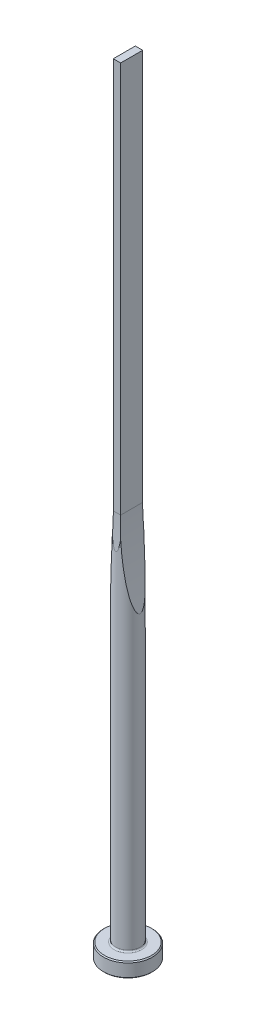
ISO-10303-21;
HEADER;
FILE_DESCRIPTION(('STEP AP214'),'2;1');
FILE_NAME('part.step','',(''),(''),'','','');
FILE_SCHEMA(('AUTOMOTIVE_DESIGN { 1 0 10303 214 1 1 1 1 }'));
ENDSEC;
DATA;
#1=APPLICATION_CONTEXT('core data for automotive mechanical design processes');
#2=APPLICATION_PROTOCOL_DEFINITION('international standard','automotive_design',2000,#1);
#3=PRODUCT_CONTEXT('',#1,'mechanical');
#4=PRODUCT('Part','Part','',(#3));
#5=PRODUCT_RELATED_PRODUCT_CATEGORY('part','',(#4));
#6=PRODUCT_DEFINITION_FORMATION('','',#4);
#7=PRODUCT_DEFINITION_CONTEXT('part definition',#1,'design');
#8=PRODUCT_DEFINITION('design','',#6,#7);
#9=PRODUCT_DEFINITION_SHAPE('','',#8);
#10=(LENGTH_UNIT() NAMED_UNIT(*) SI_UNIT(.MILLI.,.METRE.));
#11=(NAMED_UNIT(*) PLANE_ANGLE_UNIT() SI_UNIT($,.RADIAN.));
#12=(NAMED_UNIT(*) SI_UNIT($,.STERADIAN.) SOLID_ANGLE_UNIT());
#13=UNCERTAINTY_MEASURE_WITH_UNIT(LENGTH_MEASURE(1.E-05),#10,'distance_accuracy_value','');
#14=(GEOMETRIC_REPRESENTATION_CONTEXT(3) GLOBAL_UNCERTAINTY_ASSIGNED_CONTEXT((#13)) GLOBAL_UNIT_ASSIGNED_CONTEXT((#10,
#11,#12)) REPRESENTATION_CONTEXT('',''));
#15=CARTESIAN_POINT('',(0.,0.,0.));
#16=DIRECTION('',(0.,0.,1.));
#17=DIRECTION('',(1.,0.,0.));
#18=AXIS2_PLACEMENT_3D('',#15,#16,#17);
#19=CARTESIAN_POINT('',(0.,0.,0.));
#20=DIRECTION('',(0.,1.,0.));
#21=DIRECTION('',(-1.,0.,0.));
#22=AXIS2_PLACEMENT_3D('',#19,#20,#21);
#23=PLANE('',#22);
#24=CARTESIAN_POINT('',(0.,0.,0.));
#25=DIRECTION('',(0.,1.,0.));
#26=DIRECTION('',(-1.,0.,0.));
#27=AXIS2_PLACEMENT_3D('',#24,#25,#26);
#28=CIRCLE('',#27,4.8);
#29=CARTESIAN_POINT('',(-4.8,0.,0.));
#30=VERTEX_POINT('',#29);
#31=EDGE_CURVE('E133',#30,#30,#28,.T.);
#32=ORIENTED_EDGE('',*,*,#31,.F.);
#33=EDGE_LOOP('',(#32));
#34=FACE_BOUND('',#33,.T.);
#35=ADVANCED_FACE('F32',(#34),#23,.F.);
#36=CARTESIAN_POINT('',(0.,0.,0.));
#37=DIRECTION('',(0.,1.,0.));
#38=DIRECTION('',(-1.,0.,0.));
#39=AXIS2_PLACEMENT_3D('',#36,#37,#38);
#40=CONICAL_SURFACE('',#39,4.8,0.785398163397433);
#41=CARTESIAN_POINT('',(0.,0.200000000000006,0.));
#42=DIRECTION('',(0.,1.,0.));
#43=DIRECTION('',(-1.,0.,0.));
#44=AXIS2_PLACEMENT_3D('',#41,#42,#43);
#45=CIRCLE('',#44,5.);
#46=CARTESIAN_POINT('',(-5.,0.200000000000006,0.));
#47=VERTEX_POINT('',#46);
#48=EDGE_CURVE('E130',#47,#47,#45,.T.);
#49=ORIENTED_EDGE('',*,*,#48,.F.);
#50=EDGE_LOOP('',(#49));
#51=FACE_BOUND('',#50,.T.);
#52=ORIENTED_EDGE('',*,*,#31,.T.);
#53=EDGE_LOOP('',(#52));
#54=FACE_BOUND('',#53,.T.);
#55=ADVANCED_FACE('F171',(#51,#54),#40,.T.);
#56=CARTESIAN_POINT('',(0.,160.,0.));
#57=DIRECTION('',(0.,1.,0.));
#58=DIRECTION('',(-1.,0.,0.));
#59=AXIS2_PLACEMENT_3D('',#56,#57,#58);
#60=CYLINDRICAL_SURFACE('',#59,5.);
#61=CARTESIAN_POINT('',(0.,2.8,0.));
#62=DIRECTION('',(0.,1.,0.));
#63=DIRECTION('',(-1.,0.,0.));
#64=AXIS2_PLACEMENT_3D('',#61,#62,#63);
#65=CIRCLE('',#64,5.);
#66=CARTESIAN_POINT('',(-5.,2.8,0.));
#67=VERTEX_POINT('',#66);
#68=EDGE_CURVE('E127',#67,#67,#65,.T.);
#69=ORIENTED_EDGE('',*,*,#68,.F.);
#70=EDGE_LOOP('',(#69));
#71=FACE_BOUND('',#70,.T.);
#72=ORIENTED_EDGE('',*,*,#48,.T.);
#73=EDGE_LOOP('',(#72));
#74=FACE_BOUND('',#73,.T.);
#75=ADVANCED_FACE('F176',(#71,#74),#60,.T.);
#76=CARTESIAN_POINT('',(0.,2.8,0.));
#77=DIRECTION('',(0.,-1.,0.));
#78=DIRECTION('',(1.,0.,0.));
#79=AXIS2_PLACEMENT_3D('',#76,#77,#78);
#80=CONICAL_SURFACE('',#79,5.,0.785398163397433);
#81=CARTESIAN_POINT('',(0.,3.,0.));
#82=DIRECTION('',(0.,1.,0.));
#83=DIRECTION('',(-1.,0.,0.));
#84=AXIS2_PLACEMENT_3D('',#81,#82,#83);
#85=CIRCLE('',#84,4.8);
#86=CARTESIAN_POINT('',(-4.8,3.,0.));
#87=VERTEX_POINT('',#86);
#88=EDGE_CURVE('E124',#87,#87,#85,.T.);
#89=ORIENTED_EDGE('',*,*,#88,.F.);
#90=EDGE_LOOP('',(#89));
#91=FACE_BOUND('',#90,.T.);
#92=ORIENTED_EDGE('',*,*,#68,.T.);
#93=EDGE_LOOP('',(#92));
#94=FACE_BOUND('',#93,.T.);
#95=ADVANCED_FACE('F183',(#91,#94),#80,.T.);
#96=CARTESIAN_POINT('',(4.8,3.,0.));
#97=DIRECTION('',(0.,-1.,0.));
#98=DIRECTION('',(1.,0.,0.));
#99=AXIS2_PLACEMENT_3D('',#96,#97,#98);
#100=PLANE('',#99);
#101=CARTESIAN_POINT('',(0.,3.,0.));
#102=DIRECTION('',(0.,1.,0.));
#103=DIRECTION('',(-1.,0.,0.));
#104=AXIS2_PLACEMENT_3D('',#101,#102,#103);
#105=CIRCLE('',#104,2.80000000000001);
#106=CARTESIAN_POINT('',(-2.80000000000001,3.,0.));
#107=VERTEX_POINT('',#106);
#108=EDGE_CURVE('E121',#107,#107,#105,.T.);
#109=ORIENTED_EDGE('',*,*,#108,.F.);
#110=EDGE_LOOP('',(#109));
#111=FACE_BOUND('',#110,.T.);
#112=ORIENTED_EDGE('',*,*,#88,.T.);
#113=EDGE_LOOP('',(#112));
#114=FACE_BOUND('',#113,.T.);
#115=ADVANCED_FACE('F190',(#111,#114),#100,.F.);
#116=CARTESIAN_POINT('',(0.,3.3,0.));
#117=DIRECTION('',(0.,1.,0.));
#118=DIRECTION('',(-1.,0.,0.));
#119=AXIS2_PLACEMENT_3D('',#116,#117,#118);
#120=TOROIDAL_SURFACE('',#119,2.80000000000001,0.299999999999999);
#121=CARTESIAN_POINT('',(0.,3.3,0.));
#122=DIRECTION('',(0.,1.,0.));
#123=DIRECTION('',(-1.,0.,0.));
#124=AXIS2_PLACEMENT_3D('',#121,#122,#123);
#125=CIRCLE('',#124,2.50000000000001);
#126=CARTESIAN_POINT('',(-2.50000000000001,3.3,0.));
#127=VERTEX_POINT('',#126);
#128=EDGE_CURVE('E112',#127,#127,#125,.T.);
#129=ORIENTED_EDGE('',*,*,#128,.F.);
#130=EDGE_LOOP('',(#129));
#131=FACE_BOUND('',#130,.T.);
#132=ORIENTED_EDGE('',*,*,#108,.T.);
#133=EDGE_LOOP('',(#132));
#134=FACE_BOUND('',#133,.T.);
#135=ADVANCED_FACE('F168',(#131,#134),#120,.F.);
#136=CARTESIAN_POINT('',(0.,160.,0.));
#137=DIRECTION('',(0.,1.,0.));
#138=DIRECTION('',(-1.,0.,0.));
#139=AXIS2_PLACEMENT_3D('',#136,#137,#138);
#140=CYLINDRICAL_SURFACE('',#139,2.50000000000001);
#141=CARTESIAN_POINT('',(2.50000000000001,62.3382475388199,0.));
#142=CARTESIAN_POINT('',(2.49999974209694,62.3382488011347,0.0299639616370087));
#143=CARTESIAN_POINT('',(2.49945492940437,62.3409704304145,0.0599326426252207));
#144=CARTESIAN_POINT('',(2.49734508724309,62.3515176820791,0.118923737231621));
#145=CARTESIAN_POINT('',(2.49577876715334,62.3593497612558,0.147944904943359));
#146=CARTESIAN_POINT('',(2.49121080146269,62.3822164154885,0.212615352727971));
#147=CARTESIAN_POINT('',(2.48792379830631,62.3986852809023,0.247729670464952));
#148=CARTESIAN_POINT('',(2.48032463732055,62.4368342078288,0.314860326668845));
#149=CARTESIAN_POINT('',(2.47601015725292,62.4585260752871,0.346869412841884));
#150=CARTESIAN_POINT('',(2.46314736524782,62.5233470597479,0.431132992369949));
#151=CARTESIAN_POINT('',(2.45387010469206,62.5702555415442,0.480325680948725));
#152=CARTESIAN_POINT('',(2.43420180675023,62.6701866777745,0.571697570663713));
#153=CARTESIAN_POINT('',(2.42380739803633,62.7232278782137,0.613854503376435));
#154=CARTESIAN_POINT('',(2.39667456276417,62.8624034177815,0.714096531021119));
#155=CARTESIAN_POINT('',(2.37952586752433,62.9510180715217,0.768584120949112));
#156=CARTESIAN_POINT('',(2.34463996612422,63.1328433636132,0.869175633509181));
#157=CARTESIAN_POINT('',(2.32690146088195,63.2260644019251,0.915259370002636));
#158=CARTESIAN_POINT('',(2.29112604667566,63.4157610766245,1.00146229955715));
#159=CARTESIAN_POINT('',(2.27308805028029,63.512251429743,1.04154834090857));
#160=CARTESIAN_POINT('',(2.23702945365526,63.706938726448,1.11688630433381));
#161=CARTESIAN_POINT('',(2.21900885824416,63.8051335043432,1.15214391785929));
#162=CARTESIAN_POINT('',(2.18226420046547,64.0072767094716,1.22036495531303));
#163=CARTESIAN_POINT('',(2.16354509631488,64.111284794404,1.2531530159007));
#164=CARTESIAN_POINT('',(2.12630255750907,64.3203464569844,1.3153498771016));
#165=CARTESIAN_POINT('',(2.1077791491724,64.4254001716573,1.34475822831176));
#166=CARTESIAN_POINT('',(2.05256679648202,64.7418487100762,1.42880939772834));
#167=CARTESIAN_POINT('',(2.0162546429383,64.9544269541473,1.47924468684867));
#168=CARTESIAN_POINT('',(1.94480336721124,65.3820587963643,1.57198773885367));
#169=CARTESIAN_POINT('',(1.90966736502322,65.5971172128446,1.61427511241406));
#170=CARTESIAN_POINT('',(1.84079713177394,66.0285523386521,1.69238726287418));
#171=CARTESIAN_POINT('',(1.8070625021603,66.2449286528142,1.72821388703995));
#172=CARTESIAN_POINT('',(1.74100855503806,66.6790490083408,1.79473825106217));
#173=CARTESIAN_POINT('',(1.70869167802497,66.8967947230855,1.82542738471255));
#174=CARTESIAN_POINT('',(1.64558005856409,67.3330771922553,1.8825182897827));
#175=CARTESIAN_POINT('',(1.61478541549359,67.5516139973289,1.90891978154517));
#176=CARTESIAN_POINT('',(1.55479846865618,67.9889770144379,1.95808655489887));
#177=CARTESIAN_POINT('',(1.52560384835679,68.2078023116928,1.98085718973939));
#178=CARTESIAN_POINT('',(1.46879105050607,68.6459464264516,2.02334050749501));
#179=CARTESIAN_POINT('',(1.44117284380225,68.865265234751,2.04305324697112));
#180=CARTESIAN_POINT('',(1.360842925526,69.5227284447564,2.09817602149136));
#181=CARTESIAN_POINT('',(1.31050324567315,69.9614924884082,2.12969084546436));
#182=CARTESIAN_POINT('',(1.21624303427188,70.840214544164,2.18488367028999));
#183=CARTESIAN_POINT('',(1.17232299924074,71.2801726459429,2.20856106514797));
#184=CARTESIAN_POINT('',(1.09093979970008,72.1610823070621,2.24987380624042));
#185=CARTESIAN_POINT('',(1.05347835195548,72.6020340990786,2.26750754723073));
#186=CARTESIAN_POINT('',(0.985053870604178,73.4846060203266,2.29805773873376));
#187=CARTESIAN_POINT('',(0.954090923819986,73.926226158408,2.31097412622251));
#188=CARTESIAN_POINT('',(0.89863098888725,74.8107601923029,2.333099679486));
#189=CARTESIAN_POINT('',(0.874145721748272,75.2536749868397,2.34230214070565));
#190=CARTESIAN_POINT('',(0.831724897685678,76.1398716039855,2.35769843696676));
#191=CARTESIAN_POINT('',(0.813789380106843,76.5831534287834,2.36389225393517));
#192=CARTESIAN_POINT('',(0.784477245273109,77.4698869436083,2.37378057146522));
#193=CARTESIAN_POINT('',(0.773099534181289,77.9133385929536,2.37747548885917));
#194=CARTESIAN_POINT('',(0.756901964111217,78.8003809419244,2.38268159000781));
#195=CARTESIAN_POINT('',(0.752082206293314,79.2439716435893,2.38419274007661));
#196=CARTESIAN_POINT('',(0.749003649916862,80.1308026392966,2.38516164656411));
#197=CARTESIAN_POINT('',(0.750739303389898,80.5740429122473,2.38462113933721));
#198=CARTESIAN_POINT('',(0.760758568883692,81.4604353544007,2.3814437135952));
#199=CARTESIAN_POINT('',(0.769042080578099,81.9035875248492,2.37880682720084));
#200=CARTESIAN_POINT('',(0.792156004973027,82.7897658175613,2.37121007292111));
#201=CARTESIAN_POINT('',(0.806987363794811,83.2327919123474,2.36624986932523));
#202=CARTESIAN_POINT('',(0.843192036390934,84.118536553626,2.35359207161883));
#203=CARTESIAN_POINT('',(0.864565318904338,84.561255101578,2.34589449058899));
#204=CARTESIAN_POINT('',(0.913809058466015,85.4456067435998,2.32715425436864));
#205=CARTESIAN_POINT('',(0.94166989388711,85.8872404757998,2.31611654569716));
#206=CARTESIAN_POINT('',(1.00389211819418,86.7699234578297,2.28983487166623));
#207=CARTESIAN_POINT('',(1.03825343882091,87.210972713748,2.27459095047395));
#208=CARTESIAN_POINT('',(1.11344668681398,88.0922077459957,2.23874335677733));
#209=CARTESIAN_POINT('',(1.15427720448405,88.5323936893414,2.21814085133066));
#210=CARTESIAN_POINT('',(1.24237727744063,89.4117313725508,2.17003044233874));
#211=CARTESIAN_POINT('',(1.28964643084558,89.8508831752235,2.1425229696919));
#212=CARTESIAN_POINT('',(1.36514966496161,90.5069756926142,2.09457318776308));
#213=CARTESIAN_POINT('',(1.39098157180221,90.7244460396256,2.07754923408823));
#214=CARTESIAN_POINT('',(1.44420470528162,91.1589800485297,2.04091149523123));
#215=CARTESIAN_POINT('',(1.47159593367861,91.3760437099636,2.02129770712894));
#216=CARTESIAN_POINT('',(1.52793970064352,91.809818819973,1.97905052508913));
#217=CARTESIAN_POINT('',(1.55689322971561,92.0265299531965,1.95641520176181));
#218=CARTESIAN_POINT('',(1.61632244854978,92.4593433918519,1.90761148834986));
#219=CARTESIAN_POINT('',(1.64679810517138,92.675445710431,1.88144317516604));
#220=CARTESIAN_POINT('',(1.70918811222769,93.1065315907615,1.82495082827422));
#221=CARTESIAN_POINT('',(1.74109999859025,93.3215164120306,1.79463374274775));
#222=CARTESIAN_POINT('',(1.80636001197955,93.7504896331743,1.72893369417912));
#223=CARTESIAN_POINT('',(1.83970806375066,93.9644780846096,1.69355099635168));
#224=CARTESIAN_POINT('',(1.90773443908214,94.3909147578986,1.61653581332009));
#225=CARTESIAN_POINT('',(1.94241150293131,94.6033642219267,1.5749091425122));
#226=CARTESIAN_POINT('',(2.01299593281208,95.0263109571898,1.4836447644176));
#227=CARTESIAN_POINT('',(2.04890293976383,95.2368087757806,1.43400937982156));
#228=CARTESIAN_POINT('',(2.10356476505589,95.5505901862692,1.35133144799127));
#229=CARTESIAN_POINT('',(2.12194676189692,95.6550097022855,1.32235225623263));
#230=CARTESIAN_POINT('',(2.15891519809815,95.8628758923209,1.26109909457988));
#231=CARTESIAN_POINT('',(2.17750168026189,95.966322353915,1.22882442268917));
#232=CARTESIAN_POINT('',(2.2147265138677,96.1714617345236,1.16038706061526));
#233=CARTESIAN_POINT('',(2.23336438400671,96.2731599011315,1.12423994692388));
#234=CARTESIAN_POINT('',(2.27063774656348,96.4746146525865,1.04692674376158));
#235=CARTESIAN_POINT('',(2.28927323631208,96.5743720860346,1.00576290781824));
#236=CARTESIAN_POINT('',(2.32118376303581,96.7436461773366,0.929145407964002));
#237=CARTESIAN_POINT('',(2.33451045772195,96.8138685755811,0.895279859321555));
#238=CARTESIAN_POINT('',(2.36098921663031,96.9525150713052,0.822941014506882));
#239=CARTESIAN_POINT('',(2.3741398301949,97.0209264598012,0.784442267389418));
#240=CARTESIAN_POINT('',(2.395240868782,97.1300442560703,0.716644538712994));
#241=CARTESIAN_POINT('',(2.40334612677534,97.1717931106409,0.689078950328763));
#242=CARTESIAN_POINT('',(2.41922653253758,97.2532946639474,0.631069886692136));
#243=CARTESIAN_POINT('',(2.42700189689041,97.2930486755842,0.600628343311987));
#244=CARTESIAN_POINT('',(2.44198697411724,97.3694080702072,0.536450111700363));
#245=CARTESIAN_POINT('',(2.44920067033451,97.4060358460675,0.50274135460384));
#246=CARTESIAN_POINT('',(2.46282096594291,97.4749890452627,0.431091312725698));
#247=CARTESIAN_POINT('',(2.46922995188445,97.5073272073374,0.393163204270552));
#248=CARTESIAN_POINT('',(2.47874666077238,97.5552331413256,0.326373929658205));
#249=CARTESIAN_POINT('',(2.48222668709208,97.5727188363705,0.29895642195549));
#250=CARTESIAN_POINT('',(2.48843384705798,97.6038686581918,0.241907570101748));
#251=CARTESIAN_POINT('',(2.49116114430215,97.6175336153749,0.212276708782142));
#252=CARTESIAN_POINT('',(2.49564729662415,97.6399933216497,0.150685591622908));
#253=CARTESIAN_POINT('',(2.49739396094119,97.6487267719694,0.118701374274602));
#254=CARTESIAN_POINT('',(2.49963581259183,97.6599336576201,0.0536165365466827));
#255=CARTESIAN_POINT('',(2.50013290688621,97.6624166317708,0.0205176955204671));
#256=CARTESIAN_POINT('',(2.49982342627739,97.6608701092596,-0.0417297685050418));
#257=CARTESIAN_POINT('',(2.49915875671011,97.6575495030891,-0.0708993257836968));
#258=CARTESIAN_POINT('',(2.49687373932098,97.6461253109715,-0.128247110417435));
#259=CARTESIAN_POINT('',(2.49525246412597,97.6380170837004,-0.156424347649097));
#260=CARTESIAN_POINT('',(2.49052227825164,97.614334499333,-0.220589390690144));
#261=CARTESIAN_POINT('',(2.48709425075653,97.5971552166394,-0.255953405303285));
#262=CARTESIAN_POINT('',(2.47921596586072,97.5575937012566,-0.3234970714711));
#263=CARTESIAN_POINT('',(2.47476326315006,97.5351990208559,-0.355668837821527));
#264=CARTESIAN_POINT('',(2.46140541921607,97.4678553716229,-0.441105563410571));
#265=CARTESIAN_POINT('',(2.45174732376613,97.4189932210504,-0.491122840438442));
#266=CARTESIAN_POINT('',(2.43131462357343,97.3150994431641,-0.58391480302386));
#267=CARTESIAN_POINT('',(2.42053657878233,97.2600487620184,-0.626666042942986));
#268=CARTESIAN_POINT('',(2.39220322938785,97.1145507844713,-0.729097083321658));
#269=CARTESIAN_POINT('',(2.37422257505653,97.0214952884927,-0.784909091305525));
#270=CARTESIAN_POINT('',(2.33768776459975,96.8307033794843,-0.887783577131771));
#271=CARTESIAN_POINT('',(2.31913233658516,96.7329562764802,-0.934824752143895));
#272=CARTESIAN_POINT('',(2.28174701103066,96.5341613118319,-1.02270155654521));
#273=CARTESIAN_POINT('',(2.26291618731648,96.433098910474,-1.06350358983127));
#274=CARTESIAN_POINT('',(2.22530373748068,96.2292603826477,-1.14010298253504));
#275=CARTESIAN_POINT('',(2.20652207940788,96.1264864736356,-1.17590632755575));
#276=CARTESIAN_POINT('',(2.16796672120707,95.913384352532,-1.24563309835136));
#277=CARTESIAN_POINT('',(2.14820170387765,95.8029751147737,-1.27931195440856));
#278=CARTESIAN_POINT('',(2.10891098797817,95.5810797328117,-1.34308990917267));
#279=CARTESIAN_POINT('',(2.08938532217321,95.4695934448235,-1.37318852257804));
#280=CARTESIAN_POINT('',(2.03123427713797,95.133809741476,-1.45907642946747));
#281=CARTESIAN_POINT('',(1.99305498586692,94.9082986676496,-1.51042296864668));
#282=CARTESIAN_POINT('',(1.91805831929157,94.454727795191,-1.60457182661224));
#283=CARTESIAN_POINT('',(1.88124456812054,94.2266630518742,-1.64735257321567));
#284=CARTESIAN_POINT('',(1.80921725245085,93.7691961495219,-1.72614584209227));
#285=CARTESIAN_POINT('',(1.77400322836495,93.5397943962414,-1.76216031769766));
#286=CARTESIAN_POINT('',(1.70517030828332,93.079472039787,-1.8288494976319));
#287=CARTESIAN_POINT('',(1.67155501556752,92.8485492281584,-1.85951252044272));
#288=CARTESIAN_POINT('',(1.60604860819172,92.3859000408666,-1.91637340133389));
#289=CARTESIAN_POINT('',(1.57415760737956,92.1541736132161,-1.94257096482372));
#290=CARTESIAN_POINT('',(1.51218248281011,91.6904475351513,-1.99119375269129));
#291=CARTESIAN_POINT('',(1.48209570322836,91.4584488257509,-2.01362461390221));
#292=CARTESIAN_POINT('',(1.42370026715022,90.9939516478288,-2.05532485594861));
#293=CARTESIAN_POINT('',(1.39539157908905,90.7614531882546,-2.07459429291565));
#294=CARTESIAN_POINT('',(1.31314873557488,90.0632640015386,-2.12837009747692));
#295=CARTESIAN_POINT('',(1.26190609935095,89.5969415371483,-2.15883771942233));
#296=CARTESIAN_POINT('',(1.16667979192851,88.6630871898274,-2.21174240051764));
#297=CARTESIAN_POINT('',(1.12269667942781,88.195555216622,-2.23417884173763));
#298=CARTESIAN_POINT('',(1.04202589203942,87.2594850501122,-2.27292401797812));
#299=CARTESIAN_POINT('',(1.00534020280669,86.7909466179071,-2.28923108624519));
#300=CARTESIAN_POINT('',(0.939305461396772,85.8532112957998,-2.31710729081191));
#301=CARTESIAN_POINT('',(0.909956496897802,85.3840143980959,-2.32867637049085));
#302=CARTESIAN_POINT('',(0.858559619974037,84.4441951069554,-2.34811213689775));
#303=CARTESIAN_POINT('',(0.83652657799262,83.9735717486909,-2.35597129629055));
#304=CARTESIAN_POINT('',(0.799852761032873,83.0319948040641,-2.36867288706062));
#305=CARTESIAN_POINT('',(0.78521203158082,82.561041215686,-2.37351529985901));
#306=CARTESIAN_POINT('',(0.763330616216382,81.6190301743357,-2.38064242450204));
#307=CARTESIAN_POINT('',(0.756088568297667,81.1479727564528,-2.38292760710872));
#308=CARTESIAN_POINT('',(0.749002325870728,80.2057982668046,-2.38516440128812));
#309=CARTESIAN_POINT('',(0.749158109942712,79.734681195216,-2.38511601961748));
#310=CARTESIAN_POINT('',(0.756853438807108,78.7942225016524,-2.38268527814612));
#311=CARTESIAN_POINT('',(0.764366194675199,78.3248806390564,-2.38031138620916));
#312=CARTESIAN_POINT('',(0.786733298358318,77.3863892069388,-2.37301275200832));
#313=CARTESIAN_POINT('',(0.801587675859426,76.9172396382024,-2.36808799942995));
#314=CARTESIAN_POINT('',(0.838637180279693,75.9791496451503,-2.3552225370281));
#315=CARTESIAN_POINT('',(0.860834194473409,75.5102093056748,-2.34728105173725));
#316=CARTESIAN_POINT('',(0.912557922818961,74.5728143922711,-2.32766070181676));
#317=CARTESIAN_POINT('',(0.942084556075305,74.1043598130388,-2.31598187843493));
#318=CARTESIAN_POINT('',(1.00838950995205,73.1689855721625,-2.28789158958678));
#319=CARTESIAN_POINT('',(1.04515412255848,72.7020646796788,-2.27148904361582));
#320=CARTESIAN_POINT('',(1.12594221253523,71.769113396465,-2.2325470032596));
#321=CARTESIAN_POINT('',(1.16996553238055,71.303082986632,-2.21000764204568));
#322=CARTESIAN_POINT('',(1.26520845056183,70.3723956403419,-2.15690518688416));
#323=CARTESIAN_POINT('',(1.31642496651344,69.907738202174,-2.12634552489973));
#324=CARTESIAN_POINT('',(1.39859035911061,69.2120375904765,-2.07243915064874));
#325=CARTESIAN_POINT('',(1.42686749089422,68.9803623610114,-2.05312696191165));
#326=CARTESIAN_POINT('',(1.48518578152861,68.5175203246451,-2.01134664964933));
#327=CARTESIAN_POINT('',(1.5152268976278,68.2863535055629,-1.98887860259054));
#328=CARTESIAN_POINT('',(1.56799036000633,67.892305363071,-1.94735133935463));
#329=CARTESIAN_POINT('',(1.59027725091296,67.7292674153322,-1.92922300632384));
#330=CARTESIAN_POINT('',(1.63571117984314,67.4035494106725,-1.89085534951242));
#331=CARTESIAN_POINT('',(1.6588582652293,67.2408693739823,-1.87061590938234));
#332=CARTESIAN_POINT('',(1.70598789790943,66.9160083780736,-1.82773646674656));
#333=CARTESIAN_POINT('',(1.72997013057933,66.7538272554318,-1.80509736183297));
#334=CARTESIAN_POINT('',(1.7787572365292,66.4300047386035,-1.75704135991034));
#335=CARTESIAN_POINT('',(1.80356208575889,66.2683633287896,-1.73162454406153));
#336=CARTESIAN_POINT('',(1.8633089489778,65.8859565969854,-1.66752965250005));
#337=CARTESIAN_POINT('',(1.89860089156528,65.6654812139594,-1.62742787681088));
#338=CARTESIAN_POINT('',(1.97058347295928,65.2262152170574,-1.53949687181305));
#339=CARTESIAN_POINT('',(2.00727444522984,65.007425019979,-1.49166579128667));
#340=CARTESIAN_POINT('',(2.07032920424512,64.6396855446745,-1.40204474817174));
#341=CARTESIAN_POINT('',(2.09638379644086,64.4900298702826,-1.36294933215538));
#342=CARTESIAN_POINT('',(2.14892380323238,64.1926582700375,-1.27852059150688));
#343=CARTESIAN_POINT('',(2.17540887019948,64.0449409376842,-1.23319209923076));
#344=CARTESIAN_POINT('',(2.22058837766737,63.7964798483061,-1.14913893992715));
#345=CARTESIAN_POINT('',(2.23922250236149,63.6950098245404,-1.1125478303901));
#346=CARTESIAN_POINT('',(2.27650756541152,63.4938914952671,-1.03411981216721));
#347=CARTESIAN_POINT('',(2.29515847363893,63.3942467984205,-0.992273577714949));
#348=CARTESIAN_POINT('',(2.33340726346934,63.1917475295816,-0.898861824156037));
#349=CARTESIAN_POINT('',(2.35299046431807,63.0890883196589,-0.84684908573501));
#350=CARTESIAN_POINT('',(2.38169709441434,62.9399408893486,-0.760538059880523));
#351=CARTESIAN_POINT('',(2.39114177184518,62.8910973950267,-0.730433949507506));
#352=CARTESIAN_POINT('',(2.40967354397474,62.7956670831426,-0.66676764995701));
#353=CARTESIAN_POINT('',(2.41876094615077,62.749078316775,-0.633208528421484));
#354=CARTESIAN_POINT('',(2.43460713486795,62.6681584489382,-0.568820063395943));
#355=CARTESIAN_POINT('',(2.44146983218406,62.6332311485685,-0.538773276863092));
#356=CARTESIAN_POINT('',(2.45464081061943,62.5663914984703,-0.475179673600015));
#357=CARTESIAN_POINT('',(2.46094786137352,62.5344858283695,-0.44162543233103));
#358=CARTESIAN_POINT('',(2.47276187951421,62.4748705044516,-0.36986002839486));
#359=CARTESIAN_POINT('',(2.47825506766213,62.4472328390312,-0.331585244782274));
#360=CARTESIAN_POINT('',(2.48775516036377,62.3995247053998,-0.250430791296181));
#361=CARTESIAN_POINT('',(2.49176985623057,62.3794145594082,-0.207576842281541));
#362=CARTESIAN_POINT('',(2.49640282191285,62.356228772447,-0.136623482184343));
#363=CARTESIAN_POINT('',(2.4977390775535,62.349547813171,-0.109751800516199));
#364=CARTESIAN_POINT('',(2.49953747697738,62.3405581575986,-0.0552543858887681));
#365=CARTESIAN_POINT('',(2.50000023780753,62.3382463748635,-0.027629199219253));
#366=CARTESIAN_POINT('',(2.50000000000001,62.3382475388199,0.));
#367=B_SPLINE_CURVE_WITH_KNOTS('',3,(#141,#142,#143,#144,#145,#146,#147,#148,#149,#150,#151,
#152,#153,#154,#155,#156,#157,#158,#159,#160,#161,#162,#163,#164,#165,#166,#167,#168,#169,#170,
#171,#172,#173,#174,#175,#176,#177,#178,#179,#180,#181,#182,#183,#184,#185,#186,#187,#188,#189,
#190,#191,#192,#193,#194,#195,#196,#197,#198,#199,#200,#201,#202,#203,#204,#205,#206,#207,#208,
#209,#210,#211,#212,#213,#214,#215,#216,#217,#218,#219,#220,#221,#222,#223,#224,#225,#226,#227,
#228,#229,#230,#231,#232,#233,#234,#235,#236,#237,#238,#239,#240,#241,#242,#243,#244,#245,#246,
#247,#248,#249,#250,#251,#252,#253,#254,#255,#256,#257,#258,#259,#260,#261,#262,#263,#264,#265,
#266,#267,#268,#269,#270,#271,#272,#273,#274,#275,#276,#277,#278,#279,#280,#281,#282,#283,#284,
#285,#286,#287,#288,#289,#290,#291,#292,#293,#294,#295,#296,#297,#298,#299,#300,#301,#302,#303,
#304,#305,#306,#307,#308,#309,#310,#311,#312,#313,#314,#315,#316,#317,#318,#319,#320,#321,#322,
#323,#324,#325,#326,#327,#328,#329,#330,#331,#332,#333,#334,#335,#336,#337,#338,#339,#340,#341,
#342,#343,#344,#345,#346,#347,#348,#349,#350,#351,#352,#353,#354,#355,#356,#357,#358,#359,#360,
#361,#362,#363,#364,#365,#366),.UNSPECIFIED.,.T.,.F.,(4,2,2,2,2,2,2,2,2,2,2,2,2,2,2,2,2,2,2,2,2,
2,2,2,2,2,2,2,2,2,2,2,2,2,2,2,2,2,2,2,2,2,2,2,2,2,2,2,2,2,2,2,2,2,2,2,2,2,2,2,2,2,2,2,2,2,2,2,2,
2,2,2,2,2,2,2,2,2,2,2,2,2,2,2,2,2,2,2,2,2,2,2,2,2,2,2,2,2,2,2,2,2,2,2,2,2,2,2,2,2,2,2,4),(0.,
0.0897803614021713,0.179674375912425,0.295781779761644,0.412154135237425,0.616804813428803,
0.822091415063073,1.13757616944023,1.45380901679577,1.77172990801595,2.08927276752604,
2.42114730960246,2.75306593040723,3.41723541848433,4.08304593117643,4.74866577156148,
5.41538972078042,6.08215713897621,6.74793221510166,7.41369497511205,8.74183269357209,
10.0700730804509,11.3986659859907,12.7272766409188,14.0582751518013,15.3892816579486,
16.7200660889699,18.0508710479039,19.3805499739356,20.7102085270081,22.0400592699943,
23.3699036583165,24.6977881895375,26.0256587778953,27.3532404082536,28.6807392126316,
29.3397018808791,29.9986652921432,30.6580515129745,31.31742338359,31.9757041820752,
32.6339505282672,33.2915876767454,33.9490344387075,34.2787363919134,34.6085087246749,
34.9370011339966,35.2653465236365,35.5025221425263,35.7410657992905,35.8930185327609,
36.0448699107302,36.1955216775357,36.3457155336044,36.443592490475,36.5414481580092,
36.6404948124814,36.7393902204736,36.8270325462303,36.9147599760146,37.0324847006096,
37.1504933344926,37.3610616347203,37.5722969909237,37.9014204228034,38.231333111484,
38.5629640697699,38.8941944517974,39.2454528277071,39.5967587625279,40.299724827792,
41.0044395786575,41.7089505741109,42.4149806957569,43.1210573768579,43.8260678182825,
44.5310657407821,45.9412503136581,47.3515433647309,48.7622196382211,50.1729127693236,
51.5864559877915,53.0000079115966,54.4132995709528,55.8265871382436,57.2347475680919,
58.6429136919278,60.0514420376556,61.4599548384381,62.8658252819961,64.2716652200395,
65.6769045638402,66.3794590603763,67.0819965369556,67.5786321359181,68.0752951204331,
68.5717729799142,69.0682363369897,69.7486949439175,70.4293167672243,70.8997916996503,
71.3699039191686,71.6981832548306,72.0270536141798,72.3767163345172,72.5510571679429,
72.7252445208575,72.86482096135,73.0046990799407,73.1467259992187,73.2879933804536,
73.3708366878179,73.4536214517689),.UNSPECIFIED.);
#368=CARTESIAN_POINT('',(0.850781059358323,75.7420152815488,-2.3507810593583));
#369=VERTEX_POINT('',#368);
#370=CARTESIAN_POINT('',(0.850781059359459,75.7420152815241,2.35078105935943));
#371=VERTEX_POINT('',#370);
#372=EDGE_CURVE('E138',#369,#371,#367,.T.);
#373=ORIENTED_EDGE('',*,*,#372,.T.);
#374=CARTESIAN_POINT('',(-1.08972473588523,80.,2.24999999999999));
#375=CARTESIAN_POINT('',(-1.08973017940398,80.417843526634,2.25000007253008));
#376=CARTESIAN_POINT('',(-1.0837695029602,80.8356940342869,2.25291055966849));
#377=CARTESIAN_POINT('',(-1.05925903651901,81.671226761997,2.26454765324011));
#378=CARTESIAN_POINT('',(-1.04070157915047,82.0889087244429,2.27327780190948));
#379=CARTESIAN_POINT('',(-1.00139602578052,82.715075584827,2.29071964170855));
#380=CARTESIAN_POINT('',(-0.986358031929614,82.9239852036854,2.29726834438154));
#381=CARTESIAN_POINT('',(-0.951794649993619,83.3413786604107,2.31180577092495));
#382=CARTESIAN_POINT('',(-0.932269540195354,83.5498625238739,2.31979440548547));
#383=CARTESIAN_POINT('',(-0.887770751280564,83.9659737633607,2.33718458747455));
#384=CARTESIAN_POINT('',(-0.862802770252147,84.17360180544,2.34658465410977));
#385=CARTESIAN_POINT('',(-0.80581506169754,84.5878049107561,2.36677025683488));
#386=CARTESIAN_POINT('',(-0.773797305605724,84.7943802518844,2.3775554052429));
#387=CARTESIAN_POINT('',(-0.718068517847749,85.1031004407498,2.39473279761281));
#388=CARTESIAN_POINT('',(-0.69817512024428,85.2059606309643,2.40063421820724));
#389=CARTESIAN_POINT('',(-0.655081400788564,85.4110633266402,2.41275302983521));
#390=CARTESIAN_POINT('',(-0.631878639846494,85.5133053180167,2.41897065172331));
#391=CARTESIAN_POINT('',(-0.581182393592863,85.7160803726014,2.43164611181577));
#392=CARTESIAN_POINT('',(-0.553714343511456,85.8166198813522,2.43810236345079));
#393=CARTESIAN_POINT('',(-0.492483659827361,86.0157234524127,2.4512196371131));
#394=CARTESIAN_POINT('',(-0.458730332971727,86.1142901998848,2.45788034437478));
#395=CARTESIAN_POINT('',(-0.406261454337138,86.2433039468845,2.46680425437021));
#396=CARTESIAN_POINT('',(-0.392361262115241,86.2756958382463,2.46906284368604));
#397=CARTESIAN_POINT('',(-0.362888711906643,86.3398145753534,2.47356778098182));
#398=CARTESIAN_POINT('',(-0.3473125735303,86.3715397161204,2.47581408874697));
#399=CARTESIAN_POINT('',(-0.312495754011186,86.4366837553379,2.48046026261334));
#400=CARTESIAN_POINT('',(-0.29305067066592,86.4699944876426,2.48285552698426));
#401=CARTESIAN_POINT('',(-0.250541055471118,86.5342134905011,2.48750743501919));
#402=CARTESIAN_POINT('',(-0.227491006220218,86.565130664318,2.4897645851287));
#403=CARTESIAN_POINT('',(-0.19107671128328,86.6052165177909,2.49270917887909));
#404=CARTESIAN_POINT('',(-0.180024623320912,86.6164519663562,2.49353684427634));
#405=CARTESIAN_POINT('',(-0.156763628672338,86.6377261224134,2.49510762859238));
#406=CARTESIAN_POINT('',(-0.14455294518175,86.6477629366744,2.49585061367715));
#407=CARTESIAN_POINT('',(-0.118634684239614,86.666196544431,2.49721781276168));
#408=CARTESIAN_POINT('',(-0.104907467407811,86.6745665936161,2.49784008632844));
#409=CARTESIAN_POINT('',(-0.0761165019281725,86.6885607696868,2.49888187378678));
#410=CARTESIAN_POINT('',(-0.061058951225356,86.6941969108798,2.49930227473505));
#411=CARTESIAN_POINT('',(-0.0351108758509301,86.7005354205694,2.49977531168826));
#412=CARTESIAN_POINT('',(-0.0244691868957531,86.7022487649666,2.49990327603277));
#413=CARTESIAN_POINT('',(-0.00304761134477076,86.7038251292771,2.50002100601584));
#414=CARTESIAN_POINT('',(0.00773220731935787,86.7036890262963,2.5000108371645));
#415=CARTESIAN_POINT('',(0.029083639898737,86.7015838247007,2.49985362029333));
#416=CARTESIAN_POINT('',(0.0396556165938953,86.6996182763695,2.49970683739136));
#417=CARTESIAN_POINT('',(0.0603614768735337,86.6940683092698,2.49929272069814));
#418=CARTESIAN_POINT('',(0.0704949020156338,86.6904822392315,2.49902526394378));
#419=CARTESIAN_POINT('',(0.0952035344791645,86.6798195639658,2.49823093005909));
#420=CARTESIAN_POINT('',(0.109407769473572,86.6718955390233,2.49764131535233));
#421=CARTESIAN_POINT('',(0.136432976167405,86.6539792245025,2.49631126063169));
#422=CARTESIAN_POINT('',(0.149249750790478,86.6439809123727,2.49557038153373));
#423=CARTESIAN_POINT('',(0.184823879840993,86.6128486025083,2.49326963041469));
#424=CARTESIAN_POINT('',(0.205953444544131,86.5898925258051,2.49158038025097));
#425=CARTESIAN_POINT('',(0.245040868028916,86.5414729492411,2.48803849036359));
#426=CARTESIAN_POINT('',(0.262988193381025,86.5160015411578,2.48618533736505));
#427=CARTESIAN_POINT('',(0.309251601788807,86.443973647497,2.48097806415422));
#428=CARTESIAN_POINT('',(0.335237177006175,86.395943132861,2.4775415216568));
#429=CARTESIAN_POINT('',(0.382999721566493,86.297805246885,2.4706031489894));
#430=CARTESIAN_POINT('',(0.404765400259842,86.2476927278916,2.46710117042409));
#431=CARTESIAN_POINT('',(0.445440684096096,86.1460163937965,2.46008358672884));
#432=CARTESIAN_POINT('',(0.464334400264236,86.0944462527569,2.45656800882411));
#433=CARTESIAN_POINT('',(0.499871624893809,85.9906273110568,2.44958188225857));
#434=CARTESIAN_POINT('',(0.51651816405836,85.9383795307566,2.44611127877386));
#435=CARTESIAN_POINT('',(0.570055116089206,85.7604659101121,2.43445124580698));
#436=CARTESIAN_POINT('',(0.60295826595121,85.6335961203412,2.42640128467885));
#437=CARTESIAN_POINT('',(0.662697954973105,85.3783895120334,2.41075844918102));
#438=CARTESIAN_POINT('',(0.689530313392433,85.2500517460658,2.40316589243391));
#439=CARTESIAN_POINT('',(0.738831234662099,84.9922233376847,2.38847091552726));
#440=CARTESIAN_POINT('',(0.761290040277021,84.862730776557,2.38136961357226));
#441=CARTESIAN_POINT('',(0.802785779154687,84.6031659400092,2.36770048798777));
#442=CARTESIAN_POINT('',(0.82182231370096,84.4730935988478,2.36113272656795));
#443=CARTESIAN_POINT('',(0.874789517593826,84.0823835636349,2.34225784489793));
#444=CARTESIAN_POINT('',(0.904596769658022,83.8211467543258,2.330773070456));
#445=CARTESIAN_POINT('',(0.956195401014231,83.298176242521,2.31007303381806));
#446=CARTESIAN_POINT('',(0.977997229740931,83.0364436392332,2.30085481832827));
#447=CARTESIAN_POINT('',(1.01364418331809,82.5340508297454,2.28536011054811));
#448=CARTESIAN_POINT('',(1.02799698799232,82.2934317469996,2.27890378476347));
#449=CARTESIAN_POINT('',(1.05200468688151,81.8119106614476,2.26791851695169));
#450=CARTESIAN_POINT('',(1.06165936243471,81.571008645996,2.26338966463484));
#451=CARTESIAN_POINT('',(1.08427569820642,80.8477062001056,2.25269986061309));
#452=CARTESIAN_POINT('',(1.09086681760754,80.3650527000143,2.24944626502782));
#453=CARTESIAN_POINT('',(1.08826743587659,79.4005215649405,2.25070638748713));
#454=CARTESIAN_POINT('',(1.07910067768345,78.9186438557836,2.25520841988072));
#455=CARTESIAN_POINT('',(1.05232994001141,78.1965993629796,2.26774808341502));
#456=CARTESIAN_POINT('',(1.04124239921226,77.9561303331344,2.272889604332));
#457=CARTESIAN_POINT('',(1.01419155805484,77.475520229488,2.2850914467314));
#458=CARTESIAN_POINT('',(0.99822851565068,77.235379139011,2.29215166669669));
#459=CARTESIAN_POINT('',(0.960610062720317,76.75584208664,2.30816912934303));
#460=CARTESIAN_POINT('',(0.938960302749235,76.5164456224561,2.31712448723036));
#461=CARTESIAN_POINT('',(0.888559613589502,76.0381620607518,2.33692439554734));
#462=CARTESIAN_POINT('',(0.859800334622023,75.7992758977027,2.34777116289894));
#463=CARTESIAN_POINT('',(0.809334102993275,75.4415432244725,2.36543615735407));
#464=CARTESIAN_POINT('',(0.791245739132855,75.322152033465,2.37157111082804));
#465=CARTESIAN_POINT('',(0.752062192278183,75.0838917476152,2.38428850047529));
#466=CARTESIAN_POINT('',(0.730967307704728,74.9650226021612,2.39087089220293));
#467=CARTESIAN_POINT('',(0.684984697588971,74.7283066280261,2.40444765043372));
#468=CARTESIAN_POINT('',(0.660105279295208,74.6104581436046,2.41144109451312));
#469=CARTESIAN_POINT('',(0.605188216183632,74.3760080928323,2.42581353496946));
#470=CARTESIAN_POINT('',(0.57515331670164,74.2594058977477,2.43319232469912));
#471=CARTESIAN_POINT('',(0.52406451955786,74.0857489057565,2.44451548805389));
#472=CARTESIAN_POINT('',(0.50593909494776,74.0278283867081,2.44834915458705));
#473=CARTESIAN_POINT('',(0.466994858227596,73.9127359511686,2.45607737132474));
#474=CARTESIAN_POINT('',(0.446170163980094,73.8555659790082,2.45997203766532));
#475=CARTESIAN_POINT('',(0.400982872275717,73.7431082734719,2.46773856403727));
#476=CARTESIAN_POINT('',(0.376646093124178,73.6878101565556,2.47161039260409));
#477=CARTESIAN_POINT('',(0.322567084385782,73.579969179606,2.47925828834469));
#478=CARTESIAN_POINT('',(0.292848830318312,73.5274153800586,2.48303469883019));
#479=CARTESIAN_POINT('',(0.24088183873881,73.4531788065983,2.48842819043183));
#480=CARTESIAN_POINT('',(0.222183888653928,73.429059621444,2.49019123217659));
#481=CARTESIAN_POINT('',(0.181321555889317,73.3840125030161,2.49350050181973));
#482=CARTESIAN_POINT('',(0.159186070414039,73.3630606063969,2.49504834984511));
#483=CARTESIAN_POINT('',(0.124664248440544,73.3379562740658,2.49690963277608));
#484=CARTESIAN_POINT('',(0.114221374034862,73.3311807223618,2.49741292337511));
#485=CARTESIAN_POINT('',(0.0924948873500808,73.3190904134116,2.4983120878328));
#486=CARTESIAN_POINT('',(0.0812111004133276,73.3137759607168,2.49870793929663));
#487=CARTESIAN_POINT('',(0.057752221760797,73.3050206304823,2.49936060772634));
#488=CARTESIAN_POINT('',(0.0455677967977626,73.3016038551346,2.49961563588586));
#489=CARTESIAN_POINT('',(0.0207704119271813,73.2972019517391,2.49994426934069));
#490=CARTESIAN_POINT('',(0.00815830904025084,73.2962122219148,2.50001821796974));
#491=CARTESIAN_POINT('',(-0.0155552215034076,73.2967707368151,2.49997650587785));
#492=CARTESIAN_POINT('',(-0.0266642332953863,73.298041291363,2.49988159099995));
#493=CARTESIAN_POINT('',(-0.048507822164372,73.3024391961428,2.49955329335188));
#494=CARTESIAN_POINT('',(-0.0592419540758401,73.3055686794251,2.49931975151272));
#495=CARTESIAN_POINT('',(-0.0837875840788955,73.3147484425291,2.49863544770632));
#496=CARTESIAN_POINT('',(-0.0973551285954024,73.3214386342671,2.4981371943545));
#497=CARTESIAN_POINT('',(-0.123276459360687,73.3368383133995,2.49699260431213));
#498=CARTESIAN_POINT('',(-0.13562720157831,73.3455526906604,2.49634590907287));
#499=CARTESIAN_POINT('',(-0.168932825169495,73.3721120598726,2.49437960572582));
#500=CARTESIAN_POINT('',(-0.188583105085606,73.3915600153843,2.49294489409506));
#501=CARTESIAN_POINT('',(-0.225097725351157,73.4328745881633,2.48991253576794));
#502=CARTESIAN_POINT('',(-0.241952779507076,73.454748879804,2.48831437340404));
#503=CARTESIAN_POINT('',(-0.283874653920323,73.5145295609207,2.48397048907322));
#504=CARTESIAN_POINT('',(-0.307190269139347,73.5536442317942,2.48115187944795));
#505=CARTESIAN_POINT('',(-0.350288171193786,73.6337968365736,2.475431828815));
#506=CARTESIAN_POINT('',(-0.37006134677,73.6748393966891,2.47253019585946));
#507=CARTESIAN_POINT('',(-0.407174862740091,73.7582740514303,2.46669078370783));
#508=CARTESIAN_POINT('',(-0.424501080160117,73.8006723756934,2.4637528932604));
#509=CARTESIAN_POINT('',(-0.457204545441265,73.8861386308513,2.45789268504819));
#510=CARTESIAN_POINT('',(-0.472584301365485,73.9292056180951,2.45497035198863));
#511=CARTESIAN_POINT('',(-0.521348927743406,74.0734883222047,2.44528588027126));
#512=CARTESIAN_POINT('',(-0.551455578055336,74.1758119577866,2.43858951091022));
#513=CARTESIAN_POINT('',(-0.606551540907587,74.3818614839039,2.42546430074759));
#514=CARTESIAN_POINT('',(-0.63153710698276,74.4855883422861,2.41903565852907));
#515=CARTESIAN_POINT('',(-0.677824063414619,74.6941236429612,2.40647709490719));
#516=CARTESIAN_POINT('',(-0.699116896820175,74.7989340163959,2.40034789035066));
#517=CARTESIAN_POINT('',(-0.738809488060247,75.0091243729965,2.38842728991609));
#518=CARTESIAN_POINT('',(-0.757208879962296,75.1145044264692,2.38263593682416));
#519=CARTESIAN_POINT('',(-0.808916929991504,75.4311534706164,2.3657950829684));
#520=CARTESIAN_POINT('',(-0.838753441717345,75.6430174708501,2.35527359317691));
#521=CARTESIAN_POINT('',(-0.891753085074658,76.0673268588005,2.3357121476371));
#522=CARTESIAN_POINT('',(-0.914924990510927,76.2797711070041,2.32667025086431));
#523=CARTESIAN_POINT('',(-0.96365303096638,76.783788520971,2.30701281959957));
#524=CARTESIAN_POINT('',(-0.986928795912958,77.0756070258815,2.29704951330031));
#525=CARTESIAN_POINT('',(-1.02579741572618,77.6599618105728,2.27995094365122));
#526=CARTESIAN_POINT('',(-1.04138647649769,77.952498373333,2.27281707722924));
#527=CARTESIAN_POINT('',(-1.06593128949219,78.5374527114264,2.26140963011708));
#528=CARTESIAN_POINT('',(-1.07489717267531,78.8298699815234,2.25713168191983));
#529=CARTESIAN_POINT('',(-1.08679206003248,79.414857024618,2.25142680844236));
#530=CARTESIAN_POINT('',(-1.08972092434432,79.7074268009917,2.24999994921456));
#531=CARTESIAN_POINT('',(-1.08972473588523,80.,2.24999999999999));
#532=B_SPLINE_CURVE_WITH_KNOTS('',3,(#374,#375,#376,#377,#378,#379,#380,#381,#382,#383,#384,
#385,#386,#387,#388,#389,#390,#391,#392,#393,#394,#395,#396,#397,#398,#399,#400,#401,#402,#403,
#404,#405,#406,#407,#408,#409,#410,#411,#412,#413,#414,#415,#416,#417,#418,#419,#420,#421,#422,
#423,#424,#425,#426,#427,#428,#429,#430,#431,#432,#433,#434,#435,#436,#437,#438,#439,#440,#441,
#442,#443,#444,#445,#446,#447,#448,#449,#450,#451,#452,#453,#454,#455,#456,#457,#458,#459,#460,
#461,#462,#463,#464,#465,#466,#467,#468,#469,#470,#471,#472,#473,#474,#475,#476,#477,#478,#479,
#480,#481,#482,#483,#484,#485,#486,#487,#488,#489,#490,#491,#492,#493,#494,#495,#496,#497,#498,
#499,#500,#501,#502,#503,#504,#505,#506,#507,#508,#509,#510,#511,#512,#513,#514,#515,#516,#517,
#518,#519,#520,#521,#522,#523,#524,#525,#526,#527,#528,#529,#530,#531),.UNSPECIFIED.,.T.,.F.,(4,
2,2,2,2,2,2,2,2,2,2,2,2,2,2,2,2,2,2,2,2,2,2,2,2,2,2,2,2,2,2,2,2,2,2,2,2,2,2,2,2,2,2,2,2,2,2,2,2,
2,2,2,2,2,2,2,2,2,2,2,2,2,2,2,2,2,2,2,2,2,2,2,2,2,2,2,2,2,4),(0.,1.25349579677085,
2.507755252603,3.13637255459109,3.76495088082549,4.39287428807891,5.02062232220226,
5.33538342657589,5.65037772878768,5.96356106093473,6.27628429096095,6.38221512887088,
6.48839013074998,6.60421617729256,6.71958832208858,6.76687074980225,6.8142268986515,
6.86229060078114,6.91014112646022,6.94233304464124,6.97450969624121,7.00662403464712,
7.0387711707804,7.08731649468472,7.13600479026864,7.2292172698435,7.32273275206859,
7.48645092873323,7.65060127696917,7.81562908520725,7.98043205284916,8.37407968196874,
8.76799758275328,9.16278447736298,9.55761733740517,10.3469594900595,11.1352676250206,
11.8586053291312,12.5819766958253,14.0297514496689,15.4753467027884,16.1976403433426,
16.9198957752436,17.6414362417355,18.363828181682,18.726528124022,19.0891920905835,
19.4510711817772,19.8127581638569,19.9951529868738,20.177952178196,20.359470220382,
20.5401986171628,20.631742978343,20.7225557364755,20.7598439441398,20.7971399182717,
20.8348993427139,20.8725871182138,20.9059585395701,20.9393683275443,20.9845173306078,
21.0297765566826,21.1123623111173,21.1952171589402,21.3317310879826,21.468591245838,
21.6062115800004,21.7436527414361,22.0640092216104,22.3845992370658,22.705922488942,
23.0272863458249,23.6697499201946,24.3113637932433,25.1899528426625,26.0689751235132,
26.9466500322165,27.8243452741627),.UNSPECIFIED.);
#533=CARTESIAN_POINT('',(-0.85078105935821,75.7420152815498,2.35078105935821));
#534=VERTEX_POINT('',#533);
#535=EDGE_CURVE('E104',#371,#534,#532,.T.);
#536=ORIENTED_EDGE('',*,*,#535,.T.);
#537=CARTESIAN_POINT('',(-2.50000000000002,62.3382475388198,0.));
#538=CARTESIAN_POINT('',(-2.49999974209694,62.3382488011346,-0.0299639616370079));
#539=CARTESIAN_POINT('',(-2.49945492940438,62.3409704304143,-0.0599326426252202));
#540=CARTESIAN_POINT('',(-2.49734508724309,62.3515176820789,-0.118923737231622));
#541=CARTESIAN_POINT('',(-2.49577876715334,62.3593497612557,-0.14794490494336));
#542=CARTESIAN_POINT('',(-2.49121080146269,62.3822164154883,-0.212615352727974));
#543=CARTESIAN_POINT('',(-2.48792379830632,62.3986852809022,-0.247729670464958));
#544=CARTESIAN_POINT('',(-2.48032463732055,62.4368342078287,-0.314860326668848));
#545=CARTESIAN_POINT('',(-2.47601015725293,62.4585260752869,-0.34686941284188));
#546=CARTESIAN_POINT('',(-2.46314736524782,62.5233470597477,-0.431132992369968));
#547=CARTESIAN_POINT('',(-2.45387010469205,62.5702555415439,-0.4803256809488));
#548=CARTESIAN_POINT('',(-2.43420180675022,62.6701866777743,-0.571697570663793));
#549=CARTESIAN_POINT('',(-2.42380739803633,62.7232278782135,-0.613854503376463));
#550=CARTESIAN_POINT('',(-2.39667456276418,62.8624034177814,-0.714096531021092));
#551=CARTESIAN_POINT('',(-2.37952586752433,62.9510180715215,-0.768584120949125));
#552=CARTESIAN_POINT('',(-2.34463996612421,63.1328433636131,-0.869175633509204));
#553=CARTESIAN_POINT('',(-2.32690146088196,63.2260644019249,-0.915259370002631));
#554=CARTESIAN_POINT('',(-2.29112604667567,63.4157610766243,-1.00146229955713));
#555=CARTESIAN_POINT('',(-2.27308805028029,63.5122514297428,-1.04154834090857));
#556=CARTESIAN_POINT('',(-2.23702945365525,63.7069387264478,-1.11688630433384));
#557=CARTESIAN_POINT('',(-2.21900885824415,63.8051335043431,-1.15214391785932));
#558=CARTESIAN_POINT('',(-2.18226420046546,64.0072767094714,-1.22036495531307));
#559=CARTESIAN_POINT('',(-2.16354509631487,64.1112847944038,-1.25315301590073));
#560=CARTESIAN_POINT('',(-2.12630255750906,64.3203464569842,-1.31534987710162));
#561=CARTESIAN_POINT('',(-2.10777914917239,64.4254001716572,-1.34475822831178));
#562=CARTESIAN_POINT('',(-2.05256679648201,64.7418487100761,-1.42880939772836));
#563=CARTESIAN_POINT('',(-2.01625464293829,64.9544269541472,-1.47924468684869));
#564=CARTESIAN_POINT('',(-1.94480336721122,65.3820587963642,-1.57198773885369));
#565=CARTESIAN_POINT('',(-1.90966736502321,65.5971172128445,-1.61427511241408));
#566=CARTESIAN_POINT('',(-1.84079713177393,66.028552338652,-1.69238726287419));
#567=CARTESIAN_POINT('',(-1.80706250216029,66.2449286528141,-1.72821388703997));
#568=CARTESIAN_POINT('',(-1.74100855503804,66.6790490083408,-1.79473825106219));
#569=CARTESIAN_POINT('',(-1.70869167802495,66.8967947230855,-1.82542738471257));
#570=CARTESIAN_POINT('',(-1.64558005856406,67.3330771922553,-1.88251828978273));
#571=CARTESIAN_POINT('',(-1.61478541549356,67.5516139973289,-1.90891978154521));
#572=CARTESIAN_POINT('',(-1.55479846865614,67.9889770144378,-1.9580865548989));
#573=CARTESIAN_POINT('',(-1.52560384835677,68.2078023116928,-1.98085718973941));
#574=CARTESIAN_POINT('',(-1.46879105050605,68.6459464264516,-2.02334050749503));
#575=CARTESIAN_POINT('',(-1.44117284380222,68.865265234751,-2.04305324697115));
#576=CARTESIAN_POINT('',(-1.36084292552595,69.5227284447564,-2.09817602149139));
#577=CARTESIAN_POINT('',(-1.31050324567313,69.9614924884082,-2.12969084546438));
#578=CARTESIAN_POINT('',(-1.21624303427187,70.8402145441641,-2.18488367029));
#579=CARTESIAN_POINT('',(-1.17232299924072,71.280172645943,-2.20856106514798));
#580=CARTESIAN_POINT('',(-1.09093979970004,72.1610823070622,-2.24987380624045));
#581=CARTESIAN_POINT('',(-1.05347835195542,72.6020340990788,-2.26750754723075));
#582=CARTESIAN_POINT('',(-0.985053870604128,73.4846060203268,-2.29805773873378));
#583=CARTESIAN_POINT('',(-0.954090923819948,73.9262261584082,-2.31097412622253));
#584=CARTESIAN_POINT('',(-0.898630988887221,74.8107601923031,-2.33309967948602));
#585=CARTESIAN_POINT('',(-0.874145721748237,75.2536749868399,-2.34230214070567));
#586=CARTESIAN_POINT('',(-0.831724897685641,76.1398716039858,-2.35769843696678));
#587=CARTESIAN_POINT('',(-0.813789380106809,76.5831534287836,-2.36389225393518));
#588=CARTESIAN_POINT('',(-0.784477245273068,77.4698869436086,-2.37378057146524));
#589=CARTESIAN_POINT('',(-0.773099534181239,77.9133385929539,-2.37747548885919));
#590=CARTESIAN_POINT('',(-0.756901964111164,78.8003809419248,-2.38268159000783));
#591=CARTESIAN_POINT('',(-0.752082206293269,79.2439716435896,-2.38419274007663));
#592=CARTESIAN_POINT('',(-0.749003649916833,80.130802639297,-2.38516164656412));
#593=CARTESIAN_POINT('',(-0.750739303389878,80.5740429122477,-2.38462113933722));
#594=CARTESIAN_POINT('',(-0.760758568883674,81.4604353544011,-2.38144371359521));
#595=CARTESIAN_POINT('',(-0.769042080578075,81.9035875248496,-2.37880682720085));
#596=CARTESIAN_POINT('',(-0.792156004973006,82.7897658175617,-2.37121007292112));
#597=CARTESIAN_POINT('',(-0.806987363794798,83.2327919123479,-2.36624986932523));
#598=CARTESIAN_POINT('',(-0.843192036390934,84.1185365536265,-2.35359207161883));
#599=CARTESIAN_POINT('',(-0.864565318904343,84.5612551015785,-2.34589449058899));
#600=CARTESIAN_POINT('',(-0.913809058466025,85.4456067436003,-2.32715425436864));
#601=CARTESIAN_POINT('',(-0.941669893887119,85.8872404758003,-2.31611654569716));
#602=CARTESIAN_POINT('',(-1.00389211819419,86.7699234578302,-2.28983487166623));
#603=CARTESIAN_POINT('',(-1.03825343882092,87.2109727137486,-2.27459095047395));
#604=CARTESIAN_POINT('',(-1.113446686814,88.0922077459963,-2.23874335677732));
#605=CARTESIAN_POINT('',(-1.15427720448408,88.532393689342,-2.21814085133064));
#606=CARTESIAN_POINT('',(-1.24237727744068,89.4117313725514,-2.17003044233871));
#607=CARTESIAN_POINT('',(-1.28964643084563,89.8508831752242,-2.14252296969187));
#608=CARTESIAN_POINT('',(-1.36514966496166,90.5069756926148,-2.09457318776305));
#609=CARTESIAN_POINT('',(-1.39098157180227,90.7244460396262,-2.07754923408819));
#610=CARTESIAN_POINT('',(-1.44420470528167,91.1589800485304,-2.0409114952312));
#611=CARTESIAN_POINT('',(-1.47159593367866,91.3760437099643,-2.02129770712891));
#612=CARTESIAN_POINT('',(-1.52793970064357,91.8098188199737,-1.9790505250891));
#613=CARTESIAN_POINT('',(-1.55689322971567,92.0265299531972,-1.95641520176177));
#614=CARTESIAN_POINT('',(-1.61632244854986,92.4593433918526,-1.9076114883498));
#615=CARTESIAN_POINT('',(-1.64679810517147,92.6754457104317,-1.88144317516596));
#616=CARTESIAN_POINT('',(-1.70918811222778,93.1065315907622,-1.82495082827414));
#617=CARTESIAN_POINT('',(-1.74109999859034,93.3215164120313,-1.79463374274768));
#618=CARTESIAN_POINT('',(-1.80636001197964,93.750489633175,-1.72893369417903));
#619=CARTESIAN_POINT('',(-1.83970806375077,93.9644780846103,-1.69355099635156));
#620=CARTESIAN_POINT('',(-1.90773443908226,94.3909147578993,-1.61653581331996));
#621=CARTESIAN_POINT('',(-1.94241150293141,94.6033642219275,-1.57490914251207));
#622=CARTESIAN_POINT('',(-2.01299593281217,95.0263109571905,-1.48364476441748));
#623=CARTESIAN_POINT('',(-2.04890293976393,95.2368087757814,-1.43400937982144));
#624=CARTESIAN_POINT('',(-2.103564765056,95.55059018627,-1.3513314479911));
#625=CARTESIAN_POINT('',(-2.12194676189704,95.6550097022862,-1.32235225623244));
#626=CARTESIAN_POINT('',(-2.15891519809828,95.8628758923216,-1.26109909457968));
#627=CARTESIAN_POINT('',(-2.177501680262,95.9663223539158,-1.22882442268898));
#628=CARTESIAN_POINT('',(-2.21472651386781,96.1714617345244,-1.16038706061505));
#629=CARTESIAN_POINT('',(-2.23336438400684,96.2731599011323,-1.12423994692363));
#630=CARTESIAN_POINT('',(-2.27063774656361,96.4746146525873,-1.04692674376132));
#631=CARTESIAN_POINT('',(-2.2892732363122,96.5743720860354,-1.00576290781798));
#632=CARTESIAN_POINT('',(-2.32118376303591,96.7436461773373,-0.92914540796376));
#633=CARTESIAN_POINT('',(-2.33451045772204,96.8138685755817,-0.89527985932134));
#634=CARTESIAN_POINT('',(-2.36098921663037,96.9525150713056,-0.822941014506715));
#635=CARTESIAN_POINT('',(-2.37413983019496,97.0209264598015,-0.784442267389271));
#636=CARTESIAN_POINT('',(-2.39524086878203,97.1300442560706,-0.716644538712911));
#637=CARTESIAN_POINT('',(-2.40334612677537,97.1717931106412,-0.689078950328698));
#638=CARTESIAN_POINT('',(-2.41922653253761,97.2532946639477,-0.631069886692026));
#639=CARTESIAN_POINT('',(-2.42700189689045,97.2930486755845,-0.600628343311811));
#640=CARTESIAN_POINT('',(-2.4419869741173,97.3694080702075,-0.536450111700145));
#641=CARTESIAN_POINT('',(-2.44920067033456,97.4060358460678,-0.502741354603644));
#642=CARTESIAN_POINT('',(-2.46282096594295,97.4749890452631,-0.431091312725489));
#643=CARTESIAN_POINT('',(-2.46922995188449,97.5073272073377,-0.393163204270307));
#644=CARTESIAN_POINT('',(-2.47874666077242,97.555233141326,-0.326373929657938));
#645=CARTESIAN_POINT('',(-2.48222668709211,97.5727188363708,-0.298956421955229));
#646=CARTESIAN_POINT('',(-2.48843384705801,97.6038686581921,-0.241907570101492));
#647=CARTESIAN_POINT('',(-2.49116114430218,97.6175336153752,-0.212276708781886));
#648=CARTESIAN_POINT('',(-2.49564729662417,97.6399933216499,-0.150685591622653));
#649=CARTESIAN_POINT('',(-2.4973939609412,97.6487267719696,-0.118701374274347));
#650=CARTESIAN_POINT('',(-2.49963581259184,97.6599336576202,-0.0536165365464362));
#651=CARTESIAN_POINT('',(-2.50013290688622,97.6624166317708,-0.0205176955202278));
#652=CARTESIAN_POINT('',(-2.49982342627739,97.6608701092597,0.0417297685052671));
#653=CARTESIAN_POINT('',(-2.49915875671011,97.6575495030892,0.070899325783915));
#654=CARTESIAN_POINT('',(-2.49687373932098,97.6461253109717,0.128247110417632));
#655=CARTESIAN_POINT('',(-2.49525246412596,97.6380170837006,0.156424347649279));
#656=CARTESIAN_POINT('',(-2.49052227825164,97.6143344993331,0.220589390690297));
#657=CARTESIAN_POINT('',(-2.48709425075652,97.5971552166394,0.255953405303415));
#658=CARTESIAN_POINT('',(-2.4792159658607,97.5575937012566,0.323497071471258));
#659=CARTESIAN_POINT('',(-2.47476326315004,97.535199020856,0.355668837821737));
#660=CARTESIAN_POINT('',(-2.46140541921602,97.467855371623,0.441105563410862));
#661=CARTESIAN_POINT('',(-2.45174732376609,97.4189932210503,0.491122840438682));
#662=CARTESIAN_POINT('',(-2.43131462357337,97.3150994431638,0.58391480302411));
#663=CARTESIAN_POINT('',(-2.42053657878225,97.2600487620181,0.626666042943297));
#664=CARTESIAN_POINT('',(-2.39220322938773,97.1145507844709,0.729097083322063));
#665=CARTESIAN_POINT('',(-2.37422257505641,97.0214952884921,0.784909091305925));
#666=CARTESIAN_POINT('',(-2.33768776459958,96.8307033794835,0.887783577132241));
#667=CARTESIAN_POINT('',(-2.31913233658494,96.7329562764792,0.934824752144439));
#668=CARTESIAN_POINT('',(-2.2817470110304,96.5341613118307,1.02270155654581));
#669=CARTESIAN_POINT('',(-2.26291618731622,96.4330989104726,1.06350358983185));
#670=CARTESIAN_POINT('',(-2.22530373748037,96.229260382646,1.14010298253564));
#671=CARTESIAN_POINT('',(-2.20652207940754,96.1264864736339,1.17590632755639));
#672=CARTESIAN_POINT('',(-2.16796672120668,95.91338435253,1.24563309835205));
#673=CARTESIAN_POINT('',(-2.14820170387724,95.8029751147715,1.27931195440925));
#674=CARTESIAN_POINT('',(-2.10891098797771,95.5810797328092,1.3430899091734));
#675=CARTESIAN_POINT('',(-2.08938532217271,95.4695934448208,1.37318852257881));
#676=CARTESIAN_POINT('',(-2.03123427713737,95.1338097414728,1.45907642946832));
#677=CARTESIAN_POINT('',(-1.9930549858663,94.908298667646,1.51042296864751));
#678=CARTESIAN_POINT('',(-1.91805831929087,94.4547277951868,1.60457182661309));
#679=CARTESIAN_POINT('',(-1.88124456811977,94.2266630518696,1.64735257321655));
#680=CARTESIAN_POINT('',(-1.80921725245,93.7691961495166,1.72614584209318));
#681=CARTESIAN_POINT('',(-1.77400322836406,93.5397943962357,1.76216031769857));
#682=CARTESIAN_POINT('',(-1.70517030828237,93.0794720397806,1.82884949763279));
#683=CARTESIAN_POINT('',(-1.67155501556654,92.8485492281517,1.8595125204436));
#684=CARTESIAN_POINT('',(-1.60604860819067,92.3859000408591,1.91637340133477));
#685=CARTESIAN_POINT('',(-1.57415760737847,92.1541736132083,1.9425709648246));
#686=CARTESIAN_POINT('',(-1.51218248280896,91.6904475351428,1.99119375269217));
#687=CARTESIAN_POINT('',(-1.48209570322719,91.458448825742,2.01362461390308));
#688=CARTESIAN_POINT('',(-1.42370026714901,90.9939516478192,2.05532485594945));
#689=CARTESIAN_POINT('',(-1.39539157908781,90.7614531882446,2.07459429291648));
#690=CARTESIAN_POINT('',(-1.3131487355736,90.0632640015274,2.12837009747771));
#691=CARTESIAN_POINT('',(-1.26190609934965,89.5969415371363,2.15883771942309));
#692=CARTESIAN_POINT('',(-1.16667979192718,88.663087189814,2.21174240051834));
#693=CARTESIAN_POINT('',(-1.12269667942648,88.1955552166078,2.2341788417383));
#694=CARTESIAN_POINT('',(-1.04202589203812,87.2594850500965,2.27292401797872));
#695=CARTESIAN_POINT('',(-1.00534020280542,86.7909466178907,2.28923108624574));
#696=CARTESIAN_POINT('',(-0.939305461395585,85.8532112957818,2.31710729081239));
#697=CARTESIAN_POINT('',(-0.909956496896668,85.3840143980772,2.3286763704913));
#698=CARTESIAN_POINT('',(-0.858559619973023,84.4441951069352,2.34811213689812));
#699=CARTESIAN_POINT('',(-0.836526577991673,83.97357174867,2.35597129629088));
#700=CARTESIAN_POINT('',(-0.799852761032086,83.0319948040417,2.36867288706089));
#701=CARTESIAN_POINT('',(-0.785212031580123,82.5610412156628,2.37351529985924));
#702=CARTESIAN_POINT('',(-0.763330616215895,81.619030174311,2.3806424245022));
#703=CARTESIAN_POINT('',(-0.7560885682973,81.1479727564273,2.38292760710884));
#704=CARTESIAN_POINT('',(-0.749002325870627,80.2057982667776,2.38516440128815));
#705=CARTESIAN_POINT('',(-0.749158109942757,79.7346811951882,2.38511601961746));
#706=CARTESIAN_POINT('',(-0.75685343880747,78.7942225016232,2.382685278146));
#707=CARTESIAN_POINT('',(-0.76436619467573,78.3248806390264,2.38031138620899));
#708=CARTESIAN_POINT('',(-0.78673329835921,77.3863892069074,2.37301275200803));
#709=CARTESIAN_POINT('',(-0.801587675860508,76.9172396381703,2.36808799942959));
#710=CARTESIAN_POINT('',(-0.838637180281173,75.9791496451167,2.35522253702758));
#711=CARTESIAN_POINT('',(-0.860834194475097,75.5102093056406,2.34728105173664));
#712=CARTESIAN_POINT('',(-0.912557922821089,74.5728143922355,2.32766070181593));
#713=CARTESIAN_POINT('',(-0.942084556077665,74.1043598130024,2.31598187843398));
#714=CARTESIAN_POINT('',(-1.00838950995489,73.1689855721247,2.28789158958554));
#715=CARTESIAN_POINT('',(-1.04515412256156,72.7020646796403,2.27148904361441));
#716=CARTESIAN_POINT('',(-1.12594221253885,71.7691133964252,2.23254700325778));
#717=CARTESIAN_POINT('',(-1.16996553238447,71.3030829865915,2.21000764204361));
#718=CARTESIAN_POINT('',(-1.2652084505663,70.3723956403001,2.15690518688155));
#719=CARTESIAN_POINT('',(-1.31642496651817,69.9077382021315,2.12634552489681));
#720=CARTESIAN_POINT('',(-1.39859035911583,69.212037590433,2.07243915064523));
#721=CARTESIAN_POINT('',(-1.42686749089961,68.9803623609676,2.05312696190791));
#722=CARTESIAN_POINT('',(-1.48518578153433,68.5175203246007,2.01134664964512));
#723=CARTESIAN_POINT('',(-1.51522689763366,68.2863535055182,1.98887860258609));
#724=CARTESIAN_POINT('',(-1.56799036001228,67.8923053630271,1.94735133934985));
#725=CARTESIAN_POINT('',(-1.59027725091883,67.7292674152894,1.92922300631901));
#726=CARTESIAN_POINT('',(-1.63571117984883,67.4035494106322,1.8908553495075));
#727=CARTESIAN_POINT('',(-1.65885826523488,67.2408693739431,1.87061590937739));
#728=CARTESIAN_POINT('',(-1.70598789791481,66.9160083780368,1.82773646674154));
#729=CARTESIAN_POINT('',(-1.72997013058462,66.7538272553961,1.8050973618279));
#730=CARTESIAN_POINT('',(-1.77875723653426,66.4300047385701,1.75704135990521));
#731=CARTESIAN_POINT('',(-1.80356208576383,66.2683633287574,1.73162454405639));
#732=CARTESIAN_POINT('',(-1.86330894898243,65.8859565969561,1.66752965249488));
#733=CARTESIAN_POINT('',(-1.89860089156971,65.6654812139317,1.62742787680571));
#734=CARTESIAN_POINT('',(-1.97058347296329,65.2262152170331,1.53949687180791));
#735=CARTESIAN_POINT('',(-2.00727444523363,65.0074250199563,1.49166579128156));
#736=CARTESIAN_POINT('',(-2.07032920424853,64.6396855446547,1.40204474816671));
#737=CARTESIAN_POINT('',(-2.09638379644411,64.4900298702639,1.36294933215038));
#738=CARTESIAN_POINT('',(-2.14892380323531,64.1926582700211,1.27852059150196));
#739=CARTESIAN_POINT('',(-2.17540887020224,64.0449409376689,1.23319209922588));
#740=CARTESIAN_POINT('',(-2.22058837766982,63.7964798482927,1.14913893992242));
#741=CARTESIAN_POINT('',(-2.23922250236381,63.6950098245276,1.11254783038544));
#742=CARTESIAN_POINT('',(-2.27650756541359,63.4938914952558,1.03411981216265));
#743=CARTESIAN_POINT('',(-2.2951584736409,63.39424679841,0.992273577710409));
#744=CARTESIAN_POINT('',(-2.33340726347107,63.1917475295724,0.898861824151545));
#745=CARTESIAN_POINT('',(-2.35299046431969,63.0890883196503,0.846849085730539));
#746=CARTESIAN_POINT('',(-2.38169709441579,62.9399408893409,0.760538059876));
#747=CARTESIAN_POINT('',(-2.39114177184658,62.8910973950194,0.73043394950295));
#748=CARTESIAN_POINT('',(-2.40967354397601,62.7956670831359,0.666767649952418));
#749=CARTESIAN_POINT('',(-2.41876094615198,62.7490783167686,0.633208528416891));
#750=CARTESIAN_POINT('',(-2.43460713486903,62.6681584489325,0.568820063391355));
#751=CARTESIAN_POINT('',(-2.44146983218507,62.6332311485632,0.538773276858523));
#752=CARTESIAN_POINT('',(-2.4546408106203,62.5663914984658,0.475179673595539));
#753=CARTESIAN_POINT('',(-2.46094786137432,62.5344858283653,0.441625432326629));
#754=CARTESIAN_POINT('',(-2.47276187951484,62.4748705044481,0.369860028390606));
#755=CARTESIAN_POINT('',(-2.47825506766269,62.4472328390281,0.33158524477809));
#756=CARTESIAN_POINT('',(-2.48775516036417,62.3995247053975,0.250430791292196));
#757=CARTESIAN_POINT('',(-2.49176985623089,62.3794145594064,0.207576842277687));
#758=CARTESIAN_POINT('',(-2.49640282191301,62.356228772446,0.136623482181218));
#759=CARTESIAN_POINT('',(-2.49773907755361,62.3495478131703,0.109751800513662));
#760=CARTESIAN_POINT('',(-2.4995374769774,62.3405581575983,0.0552543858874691));
#761=CARTESIAN_POINT('',(-2.50000023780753,62.3382463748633,0.0276291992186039));
#762=CARTESIAN_POINT('',(-2.50000000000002,62.3382475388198,0.));
#763=B_SPLINE_CURVE_WITH_KNOTS('',3,(#537,#538,#539,#540,#541,#542,#543,#544,#545,#546,#547,
#548,#549,#550,#551,#552,#553,#554,#555,#556,#557,#558,#559,#560,#561,#562,#563,#564,#565,#566,
#567,#568,#569,#570,#571,#572,#573,#574,#575,#576,#577,#578,#579,#580,#581,#582,#583,#584,#585,
#586,#587,#588,#589,#590,#591,#592,#593,#594,#595,#596,#597,#598,#599,#600,#601,#602,#603,#604,
#605,#606,#607,#608,#609,#610,#611,#612,#613,#614,#615,#616,#617,#618,#619,#620,#621,#622,#623,
#624,#625,#626,#627,#628,#629,#630,#631,#632,#633,#634,#635,#636,#637,#638,#639,#640,#641,#642,
#643,#644,#645,#646,#647,#648,#649,#650,#651,#652,#653,#654,#655,#656,#657,#658,#659,#660,#661,
#662,#663,#664,#665,#666,#667,#668,#669,#670,#671,#672,#673,#674,#675,#676,#677,#678,#679,#680,
#681,#682,#683,#684,#685,#686,#687,#688,#689,#690,#691,#692,#693,#694,#695,#696,#697,#698,#699,
#700,#701,#702,#703,#704,#705,#706,#707,#708,#709,#710,#711,#712,#713,#714,#715,#716,#717,#718,
#719,#720,#721,#722,#723,#724,#725,#726,#727,#728,#729,#730,#731,#732,#733,#734,#735,#736,#737,
#738,#739,#740,#741,#742,#743,#744,#745,#746,#747,#748,#749,#750,#751,#752,#753,#754,#755,#756,
#757,#758,#759,#760,#761,#762),.UNSPECIFIED.,.T.,.F.,(4,2,2,2,2,2,2,2,2,2,2,2,2,2,2,2,2,2,2,2,2,
2,2,2,2,2,2,2,2,2,2,2,2,2,2,2,2,2,2,2,2,2,2,2,2,2,2,2,2,2,2,2,2,2,2,2,2,2,2,2,2,2,2,2,2,2,2,2,2,
2,2,2,2,2,2,2,2,2,2,2,2,2,2,2,2,2,2,2,2,2,2,2,2,2,2,2,2,2,2,2,2,2,2,2,2,2,2,2,2,2,2,2,4),(0.,
0.0897803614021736,0.179674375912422,0.295781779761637,0.412154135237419,0.616804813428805,
0.822091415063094,1.13757616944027,1.45380901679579,1.77172990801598,2.08927276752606,
2.4211473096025,2.75306593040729,3.41723541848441,4.08304593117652,4.74866577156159,
5.41538972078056,6.08215713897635,6.74793221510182,7.41369497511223,8.74183269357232,
10.0700730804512,11.3986659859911,12.7272766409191,14.0582751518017,15.3892816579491,
16.7200660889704,18.0508710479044,19.3805499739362,20.7102085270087,22.040059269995,
23.3699036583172,24.6977881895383,26.0256587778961,27.3532404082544,28.6807392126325,
29.33970188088,29.9986652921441,30.6580515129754,31.3174233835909,31.9757041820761,
32.6339505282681,33.2915876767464,33.9490344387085,34.2787363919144,34.6085087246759,
34.9370011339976,35.2653465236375,35.5025221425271,35.7410657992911,35.8930185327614,
36.0448699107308,36.1955216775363,36.3457155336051,36.4435924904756,36.5414481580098,
36.640494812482,36.7393902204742,36.8270325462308,36.9147599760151,37.0324847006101,
37.1504933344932,37.3610616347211,37.5722969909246,37.9014204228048,38.2313331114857,
38.562964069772,38.8941944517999,39.2454528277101,39.5967587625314,40.2997248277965,
41.0044395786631,41.7089505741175,42.4149806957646,43.1210573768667,43.8260678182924,
44.5310657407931,45.9412503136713,47.3515433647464,48.7622196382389,50.1729127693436,
51.5864559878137,53.0000079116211,54.4132995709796,55.8265871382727,57.234747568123,
58.6429136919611,60.0514420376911,61.4599548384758,62.8658252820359,64.2716652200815,
65.6769045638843,66.3794590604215,67.0819965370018,67.5786321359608,68.0752951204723,
68.57177297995,69.068236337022,69.7486949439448,70.4293167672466,70.8997916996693,
71.3699039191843,71.6981832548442,72.0270536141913,72.3767163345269,72.5510571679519,
72.7252445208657,72.8648209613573,73.004699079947,73.1467259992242,73.2879933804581,
73.3708366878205,73.4536214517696),.UNSPECIFIED.);
#764=CARTESIAN_POINT('',(-0.850781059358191,75.7420152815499,-2.35078105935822));
#765=VERTEX_POINT('',#764);
#766=EDGE_CURVE('E103',#534,#765,#763,.T.);
#767=ORIENTED_EDGE('',*,*,#766,.T.);
#768=CARTESIAN_POINT('',(0.,73.2964561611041,-2.50000000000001));
#769=CARTESIAN_POINT('',(0.0116764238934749,73.2964580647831,-2.49999985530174));
#770=CARTESIAN_POINT('',(0.0233624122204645,73.2975662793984,-2.49991706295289));
#771=CARTESIAN_POINT('',(0.0463478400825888,73.3018540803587,-2.4995969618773));
#772=CARTESIAN_POINT('',(0.0576465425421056,73.3050374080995,-2.49935937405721));
#773=CARTESIAN_POINT('',(0.0827748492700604,73.3142921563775,-2.49866943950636));
#774=CARTESIAN_POINT('',(0.0963903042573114,73.3209328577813,-2.49817483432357));
#775=CARTESIAN_POINT('',(0.122402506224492,73.3362559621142,-2.49703584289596));
#776=CARTESIAN_POINT('',(0.134796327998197,73.344943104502,-2.49639110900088));
#777=CARTESIAN_POINT('',(0.168035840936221,73.3713048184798,-2.49443925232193));
#778=CARTESIAN_POINT('',(0.187600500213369,73.3905615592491,-2.4930184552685));
#779=CARTESIAN_POINT('',(0.223964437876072,73.4314860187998,-2.49001418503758));
#780=CARTESIAN_POINT('',(0.240754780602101,73.4531611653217,-2.4884302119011));
#781=CARTESIAN_POINT('',(0.282435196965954,73.512288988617,-2.48413258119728));
#782=CARTESIAN_POINT('',(0.305603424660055,73.5509357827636,-2.48134662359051));
#783=CARTESIAN_POINT('',(0.348442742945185,73.6301439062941,-2.47569115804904));
#784=CARTESIAN_POINT('',(0.368104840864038,73.6707098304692,-2.47282145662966));
#785=CARTESIAN_POINT('',(0.405020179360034,73.7531883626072,-2.46704470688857));
#786=CARTESIAN_POINT('',(0.422259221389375,73.7951072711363,-2.46413753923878));
#787=CARTESIAN_POINT('',(0.454804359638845,73.8796141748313,-2.45833739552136));
#788=CARTESIAN_POINT('',(0.470112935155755,73.9222012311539,-2.45544440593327));
#789=CARTESIAN_POINT('',(0.518608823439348,74.0647352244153,-2.44586537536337));
#790=CARTESIAN_POINT('',(0.548555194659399,74.1657846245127,-2.43924179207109));
#791=CARTESIAN_POINT('',(0.603380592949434,74.3692819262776,-2.42625344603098));
#792=CARTESIAN_POINT('',(0.628255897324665,74.4717307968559,-2.41988887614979));
#793=CARTESIAN_POINT('',(0.674358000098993,74.6777064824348,-2.40744962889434));
#794=CARTESIAN_POINT('',(0.695576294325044,74.7812352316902,-2.40137565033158));
#795=CARTESIAN_POINT('',(0.735147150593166,74.9888617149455,-2.38955645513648));
#796=CARTESIAN_POINT('',(0.753499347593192,75.0929595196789,-2.38381128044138));
#797=CARTESIAN_POINT('',(0.805101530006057,75.4057710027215,-2.36709485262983));
#798=CARTESIAN_POINT('',(0.834913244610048,75.6150793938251,-2.3566380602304));
#799=CARTESIAN_POINT('',(0.887923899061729,76.0342757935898,-2.33716980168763));
#800=CARTESIAN_POINT('',(0.911131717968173,76.2441626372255,-2.32815640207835));
#801=CARTESIAN_POINT('',(0.967021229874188,76.8132123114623,-2.30572098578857));
#802=CARTESIAN_POINT('',(0.994786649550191,77.1729136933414,-2.29369237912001));
#803=CARTESIAN_POINT('',(1.03911475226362,77.8932972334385,-2.27393775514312));
#804=CARTESIAN_POINT('',(1.05567064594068,78.2539798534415,-2.26621434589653));
#805=CARTESIAN_POINT('',(1.07918724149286,78.9753475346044,-2.25511088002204));
#806=CARTESIAN_POINT('',(1.08615784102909,79.3360322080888,-2.25172634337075));
#807=CARTESIAN_POINT('',(1.09118070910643,80.0574772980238,-2.24929541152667));
#808=CARTESIAN_POINT('',(1.08923291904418,80.4182377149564,-2.2502490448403));
#809=CARTESIAN_POINT('',(1.07655113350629,81.1224385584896,-2.25634382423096));
#810=CARTESIAN_POINT('',(1.06623868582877,81.4658880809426,-2.26128400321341));
#811=CARTESIAN_POINT('',(1.03645913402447,82.1524317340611,-2.27508699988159));
#812=CARTESIAN_POINT('',(1.01698895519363,82.4955257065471,-2.28395113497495));
#813=CARTESIAN_POINT('',(0.967029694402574,83.1805865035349,-2.30556626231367));
#814=CARTESIAN_POINT('',(0.936548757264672,83.5225539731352,-2.31831438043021));
#815=CARTESIAN_POINT('',(0.879450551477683,84.0340245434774,-2.34029098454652));
#816=CARTESIAN_POINT('',(0.85852817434,84.2042266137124,-2.34809000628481));
#817=CARTESIAN_POINT('',(0.81191188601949,84.5439242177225,-2.36461940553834));
#818=CARTESIAN_POINT('',(0.786218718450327,84.7134198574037,-2.37334963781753));
#819=CARTESIAN_POINT('',(0.742902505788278,84.9668043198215,-2.38711547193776));
#820=CARTESIAN_POINT('',(0.727668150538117,85.0511204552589,-2.39181569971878));
#821=CARTESIAN_POINT('',(0.695277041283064,85.2193862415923,-2.40143236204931));
#822=CARTESIAN_POINT('',(0.678120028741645,85.3033358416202,-2.40634882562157));
#823=CARTESIAN_POINT('',(0.641452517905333,85.4706504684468,-2.41638155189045));
#824=CARTESIAN_POINT('',(0.621943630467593,85.5540158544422,-2.42149767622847));
#825=CARTESIAN_POINT('',(0.579894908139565,85.7199601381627,-2.43191185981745));
#826=CARTESIAN_POINT('',(0.557355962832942,85.8025392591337,-2.43720986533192));
#827=CARTESIAN_POINT('',(0.508074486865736,85.9665650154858,-2.44795727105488));
#828=CARTESIAN_POINT('',(0.481325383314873,86.0480096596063,-2.45340689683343));
#829=CARTESIAN_POINT('',(0.421622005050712,86.2088602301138,-2.46438590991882));
#830=CARTESIAN_POINT('',(0.388662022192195,86.288264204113,-2.46991536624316));
#831=CARTESIAN_POINT('',(0.330850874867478,86.4034946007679,-2.47808471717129));
#832=CARTESIAN_POINT('',(0.310114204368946,86.4413610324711,-2.48079456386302));
#833=CARTESIAN_POINT('',(0.264543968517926,86.514493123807,-2.48607244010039));
#834=CARTESIAN_POINT('',(0.239731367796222,86.5497708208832,-2.48864110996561));
#835=CARTESIAN_POINT('',(0.201290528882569,86.5942678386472,-2.49190408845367));
#836=CARTESIAN_POINT('',(0.190482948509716,86.6058850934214,-2.49275847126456));
#837=CARTESIAN_POINT('',(0.167752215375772,86.6280399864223,-2.49439177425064));
#838=CARTESIAN_POINT('',(0.155827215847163,86.6385757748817,-2.49517056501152));
#839=CARTESIAN_POINT('',(0.130542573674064,86.6581697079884,-2.49662193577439));
#840=CARTESIAN_POINT('',(0.117166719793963,86.6672075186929,-2.4972930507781));
#841=CARTESIAN_POINT('',(0.0890348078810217,86.6828073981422,-2.49845323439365));
#842=CARTESIAN_POINT('',(0.0742841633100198,86.6893787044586,-2.49894298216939));
#843=CARTESIAN_POINT('',(0.0486351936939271,86.697494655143,-2.49954832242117));
#844=CARTESIAN_POINT('',(0.0380380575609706,86.6999782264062,-2.49973373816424));
#845=CARTESIAN_POINT('',(0.0165750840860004,86.7031155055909,-2.49996799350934));
#846=CARTESIAN_POINT('',(0.00570950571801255,86.7037709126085,-2.50001695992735));
#847=CARTESIAN_POINT('',(-0.0159735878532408,86.703175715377,-2.4999725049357));
#848=CARTESIAN_POINT('',(-0.0267910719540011,86.7019240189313,-2.4998790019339));
#849=CARTESIAN_POINT('',(-0.048070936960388,86.6976578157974,-2.49956053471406));
#850=CARTESIAN_POINT('',(-0.0585329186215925,86.6946413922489,-2.49933542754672));
#851=CARTESIAN_POINT('',(-0.0827639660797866,86.6857045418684,-2.49866919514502));
#852=CARTESIAN_POINT('',(-0.0962827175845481,86.6791166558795,-2.49817852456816));
#853=CARTESIAN_POINT('',(-0.122121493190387,86.6639233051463,-2.49704915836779));
#854=CARTESIAN_POINT('',(-0.134438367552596,86.6553127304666,-2.49641008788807));
#855=CARTESIAN_POINT('',(-0.167560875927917,86.6291218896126,-2.49447078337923));
#856=CARTESIAN_POINT('',(-0.187088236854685,86.6099574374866,-2.49305669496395));
#857=CARTESIAN_POINT('',(-0.223387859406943,86.5692183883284,-2.49006575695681));
#858=CARTESIAN_POINT('',(-0.240151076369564,86.5476362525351,-2.48848839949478));
#859=CARTESIAN_POINT('',(-0.281715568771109,86.4888265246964,-2.4842133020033));
#860=CARTESIAN_POINT('',(-0.304810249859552,86.4504122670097,-2.48144358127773));
#861=CARTESIAN_POINT('',(-0.347520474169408,86.371673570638,-2.47582023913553));
#862=CARTESIAN_POINT('',(-0.367127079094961,86.3313445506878,-2.47296642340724));
#863=CARTESIAN_POINT('',(-0.403941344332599,86.2493458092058,-2.46722117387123));
#864=CARTESIAN_POINT('',(-0.421135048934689,86.2076698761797,-2.46432961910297));
#865=CARTESIAN_POINT('',(-0.453597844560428,86.123649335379,-2.45856001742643));
#866=CARTESIAN_POINT('',(-0.468869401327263,86.0813056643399,-2.45568195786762));
#867=CARTESIAN_POINT('',(-0.517228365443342,85.9396514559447,-2.44615610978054));
#868=CARTESIAN_POINT('',(-0.547093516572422,85.8392412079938,-2.43956914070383));
#869=CARTESIAN_POINT('',(-0.601781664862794,85.637024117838,-2.42664969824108));
#870=CARTESIAN_POINT('',(-0.626600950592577,85.535216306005,-2.42031741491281));
#871=CARTESIAN_POINT('',(-0.672608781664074,85.330525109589,-2.40793838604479));
#872=CARTESIAN_POINT('',(-0.693788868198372,85.2276397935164,-2.40189232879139));
#873=CARTESIAN_POINT('',(-0.733297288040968,85.0213005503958,-2.39012448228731));
#874=CARTESIAN_POINT('',(-0.751625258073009,84.9178465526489,-2.38440273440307));
#875=CARTESIAN_POINT('',(-0.803173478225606,84.6069499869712,-2.36774890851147));
#876=CARTESIAN_POINT('',(-0.832970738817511,84.3989127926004,-2.35732461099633));
#877=CARTESIAN_POINT('',(-0.885992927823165,83.9822499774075,-2.33790317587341));
#878=CARTESIAN_POINT('',(-0.909226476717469,83.7736254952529,-2.32890417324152));
#879=CARTESIAN_POINT('',(-0.957514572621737,83.2855854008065,-2.3095588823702));
#880=CARTESIAN_POINT('',(-0.980555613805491,83.0059488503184,-2.29977667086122));
#881=CARTESIAN_POINT('',(-1.01942420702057,82.4459865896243,-2.2828078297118));
#882=CARTESIAN_POINT('',(-1.03524845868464,82.1656606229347,-2.27562238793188));
#883=CARTESIAN_POINT('',(-1.06068233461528,81.6051469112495,-2.26387913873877));
#884=CARTESIAN_POINT('',(-1.07030234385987,81.3249597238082,-2.25931694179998));
#885=CARTESIAN_POINT('',(-1.08392767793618,80.7644638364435,-2.25281038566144));
#886=CARTESIAN_POINT('',(-1.08793382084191,80.4841551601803,-2.25086564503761));
#887=CARTESIAN_POINT('',(-1.09103382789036,79.8229151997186,-2.24936818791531));
#888=CARTESIAN_POINT('',(-1.08784928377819,79.4419685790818,-2.25092415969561));
#889=CARTESIAN_POINT('',(-1.07125913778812,78.6802402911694,-2.25887082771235));
#890=CARTESIAN_POINT('',(-1.05785094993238,78.2994586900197,-2.26526274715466));
#891=CARTESIAN_POINT('',(-1.02551711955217,77.6611986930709,-2.28002424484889));
#892=CARTESIAN_POINT('',(-1.00976184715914,77.4035280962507,-2.2870927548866));
#893=CARTESIAN_POINT('',(-0.971939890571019,76.888723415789,-2.30342554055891));
#894=CARTESIAN_POINT('',(-0.94987369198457,76.6315892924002,-2.31268964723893));
#895=CARTESIAN_POINT('',(-0.9061811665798,76.2006235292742,-2.33006245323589));
#896=CARTESIAN_POINT('',(-0.886688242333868,76.0265523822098,-2.33758714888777));
#897=CARTESIAN_POINT('',(-0.843219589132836,75.679003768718,-2.35361940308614));
#898=CARTESIAN_POINT('',(-0.819243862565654,75.5055263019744,-2.36212696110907));
#899=CARTESIAN_POINT('',(-0.774049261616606,75.214706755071,-2.37722945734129));
#900=CARTESIAN_POINT('',(-0.754390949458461,75.0971116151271,-2.38356872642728));
#901=CARTESIAN_POINT('',(-0.711659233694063,74.8625718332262,-2.39667152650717));
#902=CARTESIAN_POINT('',(-0.688585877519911,74.7456271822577,-2.40343505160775));
#903=CARTESIAN_POINT('',(-0.628723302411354,74.4697813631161,-2.41992652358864));
#904=CARTESIAN_POINT('',(-0.590011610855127,74.3112810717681,-2.4298292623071));
#905=CARTESIAN_POINT('',(-0.512905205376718,74.0469536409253,-2.44703280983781));
#906=CARTESIAN_POINT('',(-0.478160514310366,73.9400839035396,-2.45418436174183));
#907=CARTESIAN_POINT('',(-0.409586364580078,73.7623288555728,-2.46638919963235));
#908=CARTESIAN_POINT('',(-0.378690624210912,73.6903821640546,-2.47141933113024));
#909=CARTESIAN_POINT('',(-0.324050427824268,73.5839659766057,-2.47898077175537));
#910=CARTESIAN_POINT('',(-0.303751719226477,73.547750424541,-2.48157720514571));
#911=CARTESIAN_POINT('',(-0.259207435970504,73.4778455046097,-2.48662940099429));
#912=CARTESIAN_POINT('',(-0.234978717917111,73.444146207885,-2.48908570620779));
#913=CARTESIAN_POINT('',(-0.196684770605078,73.4006921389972,-2.49227444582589));
#914=CARTESIAN_POINT('',(-0.185221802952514,73.3886832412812,-2.49315835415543));
#915=CARTESIAN_POINT('',(-0.161034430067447,73.3659209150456,-2.49483789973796));
#916=CARTESIAN_POINT('',(-0.148307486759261,73.3551701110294,-2.49563335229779));
#917=CARTESIAN_POINT('',(-0.121186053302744,73.3354064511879,-2.49709869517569));
#918=CARTESIAN_POINT('',(-0.106766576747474,73.326426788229,-2.49776618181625));
#919=CARTESIAN_POINT('',(-0.0764389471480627,73.3115139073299,-2.49887626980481));
#920=CARTESIAN_POINT('',(-0.0605406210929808,73.305562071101,-2.49932024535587));
#921=CARTESIAN_POINT('',(-0.0369351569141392,73.2999683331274,-2.49973772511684));
#922=CARTESIAN_POINT('',(-0.0296131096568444,73.2986588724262,-2.49983549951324));
#923=CARTESIAN_POINT('',(-0.014862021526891,73.2969020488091,-2.49996669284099));
#924=CARTESIAN_POINT('',(-0.00743294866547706,73.2964549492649,-2.50000009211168));
#925=CARTESIAN_POINT('',(0.,73.2964561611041,-2.50000000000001));
#926=B_SPLINE_CURVE_WITH_KNOTS('',3,(#768,#769,#770,#771,#772,#773,#774,#775,#776,#777,#778,
#779,#780,#781,#782,#783,#784,#785,#786,#787,#788,#789,#790,#791,#792,#793,#794,#795,#796,#797,
#798,#799,#800,#801,#802,#803,#804,#805,#806,#807,#808,#809,#810,#811,#812,#813,#814,#815,#816,
#817,#818,#819,#820,#821,#822,#823,#824,#825,#826,#827,#828,#829,#830,#831,#832,#833,#834,#835,
#836,#837,#838,#839,#840,#841,#842,#843,#844,#845,#846,#847,#848,#849,#850,#851,#852,#853,#854,
#855,#856,#857,#858,#859,#860,#861,#862,#863,#864,#865,#866,#867,#868,#869,#870,#871,#872,#873,
#874,#875,#876,#877,#878,#879,#880,#881,#882,#883,#884,#885,#886,#887,#888,#889,#890,#891,#892,
#893,#894,#895,#896,#897,#898,#899,#900,#901,#902,#903,#904,#905,#906,#907,#908,#909,#910,#911,
#912,#913,#914,#915,#916,#917,#918,#919,#920,#921,#922,#923,#924,#925),.UNSPECIFIED.,.T.,.F.,(4,
2,2,2,2,2,2,2,2,2,2,2,2,2,2,2,2,2,2,2,2,2,2,2,2,2,2,2,2,2,2,2,2,2,2,2,2,2,2,2,2,2,2,2,2,2,2,2,2,
2,2,2,2,2,2,2,2,2,2,2,2,2,2,2,2,2,2,2,2,2,2,2,2,2,2,2,2,2,4),(0.,0.0349970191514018,
0.0700573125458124,0.115266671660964,0.160581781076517,0.242584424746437,0.324846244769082,
0.459929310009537,0.595354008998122,0.731541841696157,0.867552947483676,1.18410285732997,
1.50088431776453,1.81839277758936,2.13594164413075,2.77080423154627,3.40480915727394,
4.48743281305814,5.57071160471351,6.65287097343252,7.73503745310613,8.76582414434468,
9.79695716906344,10.8273290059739,11.3422637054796,11.8571182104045,12.1145320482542,
12.3719805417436,12.6292536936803,12.8864514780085,13.14405485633,13.4018961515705,
13.5315572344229,13.6605711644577,13.7081864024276,13.7558817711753,13.8041792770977,
13.8522940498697,13.8848122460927,13.9173002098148,13.9498067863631,13.9823487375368,
14.0272306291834,14.0722271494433,14.1539556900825,14.2359465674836,14.3703182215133,
14.5050293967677,14.6404901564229,14.7757753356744,15.0904156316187,15.4052865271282,
15.7208796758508,16.0365129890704,16.6675953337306,17.2978449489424,18.1399674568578,
18.9824746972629,19.8235680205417,20.6645387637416,21.8072651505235,22.9502806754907,
23.7249597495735,24.4995792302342,25.0254963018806,25.5514130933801,25.9095538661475,
26.2676896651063,26.7576499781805,27.0951425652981,27.3300209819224,27.4547000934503,
27.578857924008,27.6286656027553,27.6785753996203,27.7293464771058,27.7798014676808,
27.8020729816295,27.8243512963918),.UNSPECIFIED.);
#927=EDGE_CURVE('E115',#765,#369,#926,.T.);
#928=ORIENTED_EDGE('',*,*,#927,.T.);
#929=EDGE_LOOP('',(#373,#536,#767,#928));
#930=FACE_BOUND('',#929,.T.);
#931=ORIENTED_EDGE('',*,*,#128,.T.);
#932=EDGE_LOOP('',(#931));
#933=FACE_BOUND('',#932,.T.);
#934=ADVANCED_FACE('F147',(#930,#933),#140,.T.);
#935=CARTESIAN_POINT('',(0.,160.,0.));
#936=DIRECTION('',(0.,-1.,0.));
#937=DIRECTION('',(1.,0.,0.));
#938=AXIS2_PLACEMENT_3D('',#935,#936,#937);
#939=PLANE('',#938);
#940=DIRECTION('',(0.,0.,1.));
#941=VECTOR('',#940,1.);
#942=CARTESIAN_POINT('',(-0.750000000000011,160.,0.));
#943=LINE('',#942,#941);
#944=CARTESIAN_POINT('',(-0.750000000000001,160.,-2.25));
#945=VERTEX_POINT('',#944);
#946=CARTESIAN_POINT('',(-0.750000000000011,160.,2.24999999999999));
#947=VERTEX_POINT('',#946);
#948=EDGE_CURVE('E145',#945,#947,#943,.T.);
#949=ORIENTED_EDGE('',*,*,#948,.T.);
#950=DIRECTION('',(1.,0.,0.));
#951=VECTOR('',#950,1.);
#952=CARTESIAN_POINT('',(-5.,160.,2.25));
#953=LINE('',#952,#951);
#954=CARTESIAN_POINT('',(0.75,160.,2.25));
#955=VERTEX_POINT('',#954);
#956=EDGE_CURVE('E46',#947,#955,#953,.T.);
#957=ORIENTED_EDGE('',*,*,#956,.T.);
#958=DIRECTION('',(0.,0.,-1.));
#959=VECTOR('',#958,1.);
#960=CARTESIAN_POINT('',(0.74999999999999,160.,0.));
#961=LINE('',#960,#959);
#962=CARTESIAN_POINT('',(0.75,160.,-2.25));
#963=VERTEX_POINT('',#962);
#964=EDGE_CURVE('E136',#955,#963,#961,.T.);
#965=ORIENTED_EDGE('',*,*,#964,.T.);
#966=DIRECTION('',(1.,0.,0.));
#967=VECTOR('',#966,1.);
#968=CARTESIAN_POINT('',(-5.,160.,-2.25));
#969=LINE('',#968,#967);
#970=EDGE_CURVE('E291',#945,#963,#969,.T.);
#971=ORIENTED_EDGE('',*,*,#970,.F.);
#972=EDGE_LOOP('',(#949,#957,#965,#971));
#973=FACE_BOUND('',#972,.T.);
#974=ADVANCED_FACE('F157',(#973),#939,.F.);
#975=CARTESIAN_POINT('',(90.75,80.,-5.));
#976=DIRECTION('',(0.,0.,1.));
#977=DIRECTION('',(1.,0.,0.));
#978=AXIS2_PLACEMENT_3D('',#975,#976,#977);
#979=CYLINDRICAL_SURFACE('',#978,90.);
#980=DIRECTION('',(0.,0.,1.));
#981=VECTOR('',#980,1.);
#982=CARTESIAN_POINT('',(0.75000000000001,80.,-5.));
#983=LINE('',#982,#981);
#984=CARTESIAN_POINT('',(0.75,80.,-2.25000000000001));
#985=VERTEX_POINT('',#984);
#986=CARTESIAN_POINT('',(0.750000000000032,80.,2.24999999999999));
#987=VERTEX_POINT('',#986);
#988=EDGE_CURVE('E108',#985,#987,#983,.T.);
#989=ORIENTED_EDGE('',*,*,#988,.T.);
#990=CARTESIAN_POINT('',(90.75,80.,92.25));
#991=DIRECTION('',(-0.707106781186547,0.,0.707106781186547));
#992=DIRECTION('',(0.707106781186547,0.,0.707106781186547));
#993=AXIS2_PLACEMENT_3D('',#990,#991,#992);
#994=ELLIPSE('',#993,127.279220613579,90.);
#995=EDGE_CURVE('E96',#987,#371,#994,.T.);
#996=ORIENTED_EDGE('',*,*,#995,.T.);
#997=ORIENTED_EDGE('',*,*,#372,.F.);
#998=CARTESIAN_POINT('',(90.75,80.,-92.25));
#999=DIRECTION('',(0.707106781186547,0.,0.707106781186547));
#1000=DIRECTION('',(-0.707106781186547,0.,0.707106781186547));
#1001=AXIS2_PLACEMENT_3D('',#998,#999,#1000);
#1002=ELLIPSE('',#1001,127.279220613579,90.);
#1003=EDGE_CURVE('E109',#369,#985,#1002,.F.);
#1004=ORIENTED_EDGE('',*,*,#1003,.T.);
#1005=EDGE_LOOP('',(#989,#996,#997,#1004));
#1006=FACE_BOUND('',#1005,.T.);
#1007=ADVANCED_FACE('F151',(#1006),#979,.F.);
#1008=CARTESIAN_POINT('',(0.74999999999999,160.,-5.));
#1009=DIRECTION('',(-1.,0.,0.));
#1010=DIRECTION('',(0.,-1.,0.));
#1011=AXIS2_PLACEMENT_3D('',#1008,#1009,#1010);
#1012=PLANE('',#1011);
#1013=ORIENTED_EDGE('',*,*,#964,.F.);
#1014=DIRECTION('',(0.,-1.,0.));
#1015=VECTOR('',#1014,1.);
#1016=CARTESIAN_POINT('',(0.74999999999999,160.,2.25));
#1017=LINE('',#1016,#1015);
#1018=EDGE_CURVE('E289',#955,#987,#1017,.T.);
#1019=ORIENTED_EDGE('',*,*,#1018,.T.);
#1020=ORIENTED_EDGE('',*,*,#988,.F.);
#1021=DIRECTION('',(0.,1.,0.));
#1022=VECTOR('',#1021,1.);
#1023=CARTESIAN_POINT('',(0.74999999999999,160.,-2.25));
#1024=LINE('',#1023,#1022);
#1025=EDGE_CURVE('E293',#985,#963,#1024,.T.);
#1026=ORIENTED_EDGE('',*,*,#1025,.T.);
#1027=EDGE_LOOP('',(#1013,#1019,#1020,#1026));
#1028=FACE_BOUND('',#1027,.T.);
#1029=ADVANCED_FACE('F156',(#1028),#1012,.F.);
#1030=CARTESIAN_POINT('',(-90.75,80.,-5.));
#1031=DIRECTION('',(0.,0.,1.));
#1032=DIRECTION('',(1.,0.,0.));
#1033=AXIS2_PLACEMENT_3D('',#1030,#1031,#1032);
#1034=CYLINDRICAL_SURFACE('',#1033,90.);
#1035=ORIENTED_EDGE('',*,*,#766,.F.);
#1036=CARTESIAN_POINT('',(-90.75,80.,92.25));
#1037=DIRECTION('',(0.707106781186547,0.,0.707106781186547));
#1038=DIRECTION('',(-0.707106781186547,0.,0.707106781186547));
#1039=AXIS2_PLACEMENT_3D('',#1036,#1037,#1038);
#1040=ELLIPSE('',#1039,127.279220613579,90.);
#1041=CARTESIAN_POINT('',(-0.750000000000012,80.,2.24999999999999));
#1042=VERTEX_POINT('',#1041);
#1043=EDGE_CURVE('E93',#534,#1042,#1040,.T.);
#1044=ORIENTED_EDGE('',*,*,#1043,.T.);
#1045=DIRECTION('',(0.,0.,1.));
#1046=VECTOR('',#1045,1.);
#1047=CARTESIAN_POINT('',(-0.74999999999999,80.,-5.));
#1048=LINE('',#1047,#1046);
#1049=CARTESIAN_POINT('',(-0.74999999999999,80.,-2.25000000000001));
#1050=VERTEX_POINT('',#1049);
#1051=EDGE_CURVE('E102',#1050,#1042,#1048,.T.);
#1052=ORIENTED_EDGE('',*,*,#1051,.F.);
#1053=CARTESIAN_POINT('',(-90.75,80.,-92.25));
#1054=DIRECTION('',(-0.707106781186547,0.,0.707106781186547));
#1055=DIRECTION('',(0.707106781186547,0.,0.707106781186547));
#1056=AXIS2_PLACEMENT_3D('',#1053,#1054,#1055);
#1057=ELLIPSE('',#1056,127.279220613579,90.);
#1058=EDGE_CURVE('E298',#1050,#765,#1057,.F.);
#1059=ORIENTED_EDGE('',*,*,#1058,.T.);
#1060=EDGE_LOOP('',(#1035,#1044,#1052,#1059));
#1061=FACE_BOUND('',#1060,.T.);
#1062=ADVANCED_FACE('F100',(#1061),#1034,.F.);
#1063=CARTESIAN_POINT('',(-0.750000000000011,160.,-5.));
#1064=DIRECTION('',(1.,0.,0.));
#1065=DIRECTION('',(0.,1.,0.));
#1066=AXIS2_PLACEMENT_3D('',#1063,#1064,#1065);
#1067=PLANE('',#1066);
#1068=ORIENTED_EDGE('',*,*,#1051,.T.);
#1069=DIRECTION('',(0.,1.,0.));
#1070=VECTOR('',#1069,1.);
#1071=CARTESIAN_POINT('',(-0.750000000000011,160.,2.25));
#1072=LINE('',#1071,#1070);
#1073=EDGE_CURVE('E11',#1042,#947,#1072,.T.);
#1074=ORIENTED_EDGE('',*,*,#1073,.T.);
#1075=ORIENTED_EDGE('',*,*,#948,.F.);
#1076=DIRECTION('',(0.,-1.,0.));
#1077=VECTOR('',#1076,1.);
#1078=CARTESIAN_POINT('',(-0.750000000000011,160.,-2.25));
#1079=LINE('',#1078,#1077);
#1080=EDGE_CURVE('E39',#945,#1050,#1079,.T.);
#1081=ORIENTED_EDGE('',*,*,#1080,.T.);
#1082=EDGE_LOOP('',(#1068,#1074,#1075,#1081));
#1083=FACE_BOUND('',#1082,.T.);
#1084=ADVANCED_FACE('F107',(#1083),#1067,.F.);
#1085=CARTESIAN_POINT('',(-5.,80.,-92.25));
#1086=DIRECTION('',(1.,0.,0.));
#1087=DIRECTION('',(0.,0.,-1.));
#1088=AXIS2_PLACEMENT_3D('',#1085,#1086,#1087);
#1089=CYLINDRICAL_SURFACE('',#1088,90.);
#1090=ORIENTED_EDGE('',*,*,#927,.F.);
#1091=ORIENTED_EDGE('',*,*,#1058,.F.);
#1092=DIRECTION('',(1.,0.,0.));
#1093=VECTOR('',#1092,1.);
#1094=CARTESIAN_POINT('',(-5.,80.,-2.25000000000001));
#1095=LINE('',#1094,#1093);
#1096=EDGE_CURVE('E53',#1050,#985,#1095,.T.);
#1097=ORIENTED_EDGE('',*,*,#1096,.T.);
#1098=ORIENTED_EDGE('',*,*,#1003,.F.);
#1099=EDGE_LOOP('',(#1090,#1091,#1097,#1098));
#1100=FACE_BOUND('',#1099,.T.);
#1101=ADVANCED_FACE('F245',(#1100),#1089,.F.);
#1102=CARTESIAN_POINT('',(-5.,160.,-2.25));
#1103=DIRECTION('',(0.,0.,1.));
#1104=DIRECTION('',(0.,-1.,0.));
#1105=AXIS2_PLACEMENT_3D('',#1102,#1103,#1104);
#1106=PLANE('',#1105);
#1107=ORIENTED_EDGE('',*,*,#1096,.F.);
#1108=ORIENTED_EDGE('',*,*,#1080,.F.);
#1109=ORIENTED_EDGE('',*,*,#970,.T.);
#1110=ORIENTED_EDGE('',*,*,#1025,.F.);
#1111=EDGE_LOOP('',(#1107,#1108,#1109,#1110));
#1112=FACE_BOUND('',#1111,.T.);
#1113=ADVANCED_FACE('F253',(#1112),#1106,.F.);
#1114=CARTESIAN_POINT('',(-5.,160.,2.25));
#1115=DIRECTION('',(0.,0.,-1.));
#1116=DIRECTION('',(0.,1.,0.));
#1117=AXIS2_PLACEMENT_3D('',#1114,#1115,#1116);
#1118=PLANE('',#1117);
#1119=ORIENTED_EDGE('',*,*,#956,.F.);
#1120=ORIENTED_EDGE('',*,*,#1073,.F.);
#1121=DIRECTION('',(1.,0.,0.));
#1122=VECTOR('',#1121,1.);
#1123=CARTESIAN_POINT('',(-5.,80.,2.24999999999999));
#1124=LINE('',#1123,#1122);
#1125=EDGE_CURVE('E83',#1042,#987,#1124,.T.);
#1126=ORIENTED_EDGE('',*,*,#1125,.T.);
#1127=ORIENTED_EDGE('',*,*,#1018,.F.);
#1128=EDGE_LOOP('',(#1119,#1120,#1126,#1127));
#1129=FACE_BOUND('',#1128,.T.);
#1130=ADVANCED_FACE('F82',(#1129),#1118,.F.);
#1131=CARTESIAN_POINT('',(-5.,80.,92.25));
#1132=DIRECTION('',(1.,0.,0.));
#1133=DIRECTION('',(0.,0.,-1.));
#1134=AXIS2_PLACEMENT_3D('',#1131,#1132,#1133);
#1135=CYLINDRICAL_SURFACE('',#1134,90.);
#1136=ORIENTED_EDGE('',*,*,#1125,.F.);
#1137=ORIENTED_EDGE('',*,*,#1043,.F.);
#1138=ORIENTED_EDGE('',*,*,#535,.F.);
#1139=ORIENTED_EDGE('',*,*,#995,.F.);
#1140=EDGE_LOOP('',(#1136,#1137,#1138,#1139));
#1141=FACE_BOUND('',#1140,.T.);
#1142=ADVANCED_FACE('F92',(#1141),#1135,.F.);
#1143=CLOSED_SHELL('',(#35,#55,#75,#95,#115,#135,#934,#974,#1007,#1029,#1062,#1084,#1101,#1113,
#1130,#1142));
#1144=MANIFOLD_SOLID_BREP('B2',#1143);
#1145=ADVANCED_BREP_SHAPE_REPRESENTATION('',(#18,#1144),#14);
#1146=SHAPE_DEFINITION_REPRESENTATION(#9,#1145);
ENDSEC;
END-ISO-10303-21;
